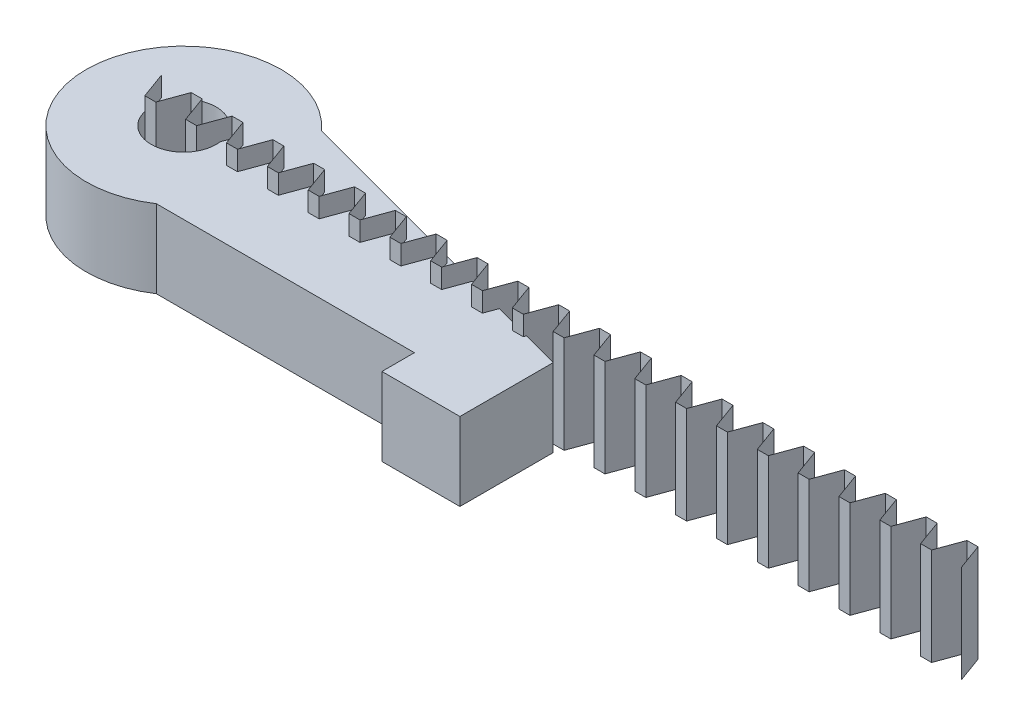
ISO-10303-21;
HEADER;
FILE_DESCRIPTION(('STEP AP214'),'2;1');
FILE_NAME('part.step','',(''),(''),'','','');
FILE_SCHEMA(('AUTOMOTIVE_DESIGN { 1 0 10303 214 1 1 1 1 }'));
ENDSEC;
DATA;
#1=APPLICATION_CONTEXT('core data for automotive mechanical design processes');
#2=APPLICATION_PROTOCOL_DEFINITION('international standard','automotive_design',2000,#1);
#3=PRODUCT_CONTEXT('',#1,'mechanical');
#4=PRODUCT('Part','Part','',(#3));
#5=PRODUCT_RELATED_PRODUCT_CATEGORY('part','',(#4));
#6=PRODUCT_DEFINITION_FORMATION('','',#4);
#7=PRODUCT_DEFINITION_CONTEXT('part definition',#1,'design');
#8=PRODUCT_DEFINITION('design','',#6,#7);
#9=PRODUCT_DEFINITION_SHAPE('','',#8);
#10=(LENGTH_UNIT() NAMED_UNIT(*) SI_UNIT(.MILLI.,.METRE.));
#11=(NAMED_UNIT(*) PLANE_ANGLE_UNIT() SI_UNIT($,.RADIAN.));
#12=(NAMED_UNIT(*) SI_UNIT($,.STERADIAN.) SOLID_ANGLE_UNIT());
#13=UNCERTAINTY_MEASURE_WITH_UNIT(LENGTH_MEASURE(1.E-05),#10,'distance_accuracy_value','');
#14=(GEOMETRIC_REPRESENTATION_CONTEXT(3) GLOBAL_UNCERTAINTY_ASSIGNED_CONTEXT((#13)) GLOBAL_UNIT_ASSIGNED_CONTEXT((#10,
#11,#12)) REPRESENTATION_CONTEXT('',''));
#15=CARTESIAN_POINT('',(0.,0.,0.));
#16=DIRECTION('',(0.,0.,1.));
#17=DIRECTION('',(1.,0.,0.));
#18=AXIS2_PLACEMENT_3D('',#15,#16,#17);
#19=CARTESIAN_POINT('',(-5.4403294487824,0.,-2.));
#20=DIRECTION('',(-0.939692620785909,0.,0.342020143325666));
#21=DIRECTION('',(0.342020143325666,0.,0.939692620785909));
#22=AXIS2_PLACEMENT_3D('',#19,#20,#21);
#23=PLANE('',#22);
#24=DIRECTION('',(0.342020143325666,0.,0.939692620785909));
#25=VECTOR('',#24,1.);
#26=CARTESIAN_POINT('',(-5.4403294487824,15.,-2.));
#27=LINE('',#26,#25);
#28=CARTESIAN_POINT('',(-5.4403294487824,15.,-2.));
#29=VERTEX_POINT('',#28);
#30=CARTESIAN_POINT('',(-3.9844485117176,15.,2.));
#31=VERTEX_POINT('',#30);
#32=EDGE_CURVE('E554',#29,#31,#27,.T.);
#33=ORIENTED_EDGE('',*,*,#32,.F.);
#34=DIRECTION('',(0.,1.,0.));
#35=VECTOR('',#34,1.);
#36=CARTESIAN_POINT('',(-5.4403294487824,0.,-2.));
#37=LINE('',#36,#35);
#38=CARTESIAN_POINT('',(-5.4403294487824,0.,-2.));
#39=VERTEX_POINT('',#38);
#40=EDGE_CURVE('E49',#39,#29,#37,.T.);
#41=ORIENTED_EDGE('',*,*,#40,.F.);
#42=DIRECTION('',(0.342020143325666,0.,0.939692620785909));
#43=VECTOR('',#42,1.);
#44=CARTESIAN_POINT('',(-5.4403294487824,0.,-2.));
#45=LINE('',#44,#43);
#46=CARTESIAN_POINT('',(-3.9844485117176,0.,2.));
#47=VERTEX_POINT('',#46);
#48=EDGE_CURVE('E12',#39,#47,#45,.T.);
#49=ORIENTED_EDGE('',*,*,#48,.T.);
#50=DIRECTION('',(0.,1.,0.));
#51=VECTOR('',#50,1.);
#52=CARTESIAN_POINT('',(-3.9844485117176,0.,2.));
#53=LINE('',#52,#51);
#54=EDGE_CURVE('E556',#47,#31,#53,.T.);
#55=ORIENTED_EDGE('',*,*,#54,.T.);
#56=EDGE_LOOP('',(#33,#41,#49,#55));
#57=FACE_BOUND('',#56,.T.);
#58=ADVANCED_FACE('F47',(#57),#23,.T.);
#59=CARTESIAN_POINT('',(-3.9844485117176,0.,2.));
#60=DIRECTION('',(0.,0.,1.));
#61=DIRECTION('',(1.,0.,0.));
#62=AXIS2_PLACEMENT_3D('',#59,#60,#61);
#63=PLANE('',#62);
#64=DIRECTION('',(1.,0.,0.));
#65=VECTOR('',#64,1.);
#66=CARTESIAN_POINT('',(-3.9844485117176,15.,2.));
#67=LINE('',#66,#65);
#68=CARTESIAN_POINT('',(-2.2987367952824,15.,2.));
#69=VERTEX_POINT('',#68);
#70=EDGE_CURVE('E567',#31,#69,#67,.T.);
#71=ORIENTED_EDGE('',*,*,#70,.F.);
#72=ORIENTED_EDGE('',*,*,#54,.F.);
#73=DIRECTION('',(1.,0.,0.));
#74=VECTOR('',#73,1.);
#75=CARTESIAN_POINT('',(-3.9844485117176,0.,2.));
#76=LINE('',#75,#74);
#77=CARTESIAN_POINT('',(-2.2987367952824,0.,2.));
#78=VERTEX_POINT('',#77);
#79=EDGE_CURVE('E559',#47,#78,#76,.T.);
#80=ORIENTED_EDGE('',*,*,#79,.T.);
#81=DIRECTION('',(0.,1.,0.));
#82=VECTOR('',#81,1.);
#83=CARTESIAN_POINT('',(-2.2987367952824,0.,2.));
#84=LINE('',#83,#82);
#85=EDGE_CURVE('E576',#78,#69,#84,.T.);
#86=ORIENTED_EDGE('',*,*,#85,.T.);
#87=EDGE_LOOP('',(#71,#72,#80,#86));
#88=FACE_BOUND('',#87,.T.);
#89=ADVANCED_FACE('F1362',(#88),#63,.T.);
#90=CARTESIAN_POINT('',(-2.2987367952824,0.,2.));
#91=DIRECTION('',(0.939692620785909,0.,0.342020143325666));
#92=DIRECTION('',(0.342020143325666,0.,-0.939692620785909));
#93=AXIS2_PLACEMENT_3D('',#90,#91,#92);
#94=PLANE('',#93);
#95=DIRECTION('',(0.342020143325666,0.,-0.939692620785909));
#96=VECTOR('',#95,1.);
#97=CARTESIAN_POINT('',(-2.2987367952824,15.,2.));
#98=LINE('',#97,#96);
#99=CARTESIAN_POINT('',(-0.842855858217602,15.,-2.));
#100=VERTEX_POINT('',#99);
#101=EDGE_CURVE('E572',#69,#100,#98,.T.);
#102=ORIENTED_EDGE('',*,*,#101,.F.);
#103=ORIENTED_EDGE('',*,*,#85,.F.);
#104=DIRECTION('',(0.342020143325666,0.,-0.939692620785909));
#105=VECTOR('',#104,1.);
#106=CARTESIAN_POINT('',(-2.2987367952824,0.,2.));
#107=LINE('',#106,#105);
#108=CARTESIAN_POINT('',(-0.842855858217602,0.,-2.));
#109=VERTEX_POINT('',#108);
#110=EDGE_CURVE('E571',#78,#109,#107,.T.);
#111=ORIENTED_EDGE('',*,*,#110,.T.);
#112=DIRECTION('',(0.,1.,0.));
#113=VECTOR('',#112,1.);
#114=CARTESIAN_POINT('',(-0.842855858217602,0.,-2.));
#115=LINE('',#114,#113);
#116=EDGE_CURVE('E582',#109,#100,#115,.T.);
#117=ORIENTED_EDGE('',*,*,#116,.T.);
#118=EDGE_LOOP('',(#102,#103,#111,#117));
#119=FACE_BOUND('',#118,.T.);
#120=ADVANCED_FACE('F1366',(#119),#94,.T.);
#121=CARTESIAN_POINT('',(-0.842855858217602,0.,-2.));
#122=DIRECTION('',(0.,0.,1.));
#123=DIRECTION('',(1.,0.,0.));
#124=AXIS2_PLACEMENT_3D('',#121,#122,#123);
#125=PLANE('',#124);
#126=DIRECTION('',(1.,0.,0.));
#127=VECTOR('',#126,1.);
#128=CARTESIAN_POINT('',(-0.842855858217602,15.,-2.));
#129=LINE('',#128,#127);
#130=CARTESIAN_POINT('',(0.842855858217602,15.,-2.));
#131=VERTEX_POINT('',#130);
#132=EDGE_CURVE('E578',#100,#131,#129,.T.);
#133=ORIENTED_EDGE('',*,*,#132,.F.);
#134=ORIENTED_EDGE('',*,*,#116,.F.);
#135=DIRECTION('',(1.,0.,0.));
#136=VECTOR('',#135,1.);
#137=CARTESIAN_POINT('',(-0.842855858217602,0.,-2.));
#138=LINE('',#137,#136);
#139=CARTESIAN_POINT('',(0.842855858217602,0.,-2.));
#140=VERTEX_POINT('',#139);
#141=EDGE_CURVE('E577',#109,#140,#138,.T.);
#142=ORIENTED_EDGE('',*,*,#141,.T.);
#143=DIRECTION('',(0.,1.,0.));
#144=VECTOR('',#143,1.);
#145=CARTESIAN_POINT('',(0.842855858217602,0.,-2.));
#146=LINE('',#145,#144);
#147=EDGE_CURVE('E588',#140,#131,#146,.T.);
#148=ORIENTED_EDGE('',*,*,#147,.T.);
#149=EDGE_LOOP('',(#133,#134,#142,#148));
#150=FACE_BOUND('',#149,.T.);
#151=ADVANCED_FACE('F1370',(#150),#125,.T.);
#152=CARTESIAN_POINT('',(0.842855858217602,0.,-2.));
#153=DIRECTION('',(-0.939692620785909,0.,0.342020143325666));
#154=DIRECTION('',(0.342020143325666,0.,0.939692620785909));
#155=AXIS2_PLACEMENT_3D('',#152,#153,#154);
#156=PLANE('',#155);
#157=DIRECTION('',(0.342020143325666,0.,0.939692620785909));
#158=VECTOR('',#157,1.);
#159=CARTESIAN_POINT('',(0.842855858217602,15.,-2.));
#160=LINE('',#159,#158);
#161=CARTESIAN_POINT('',(2.2987367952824,15.,2.));
#162=VERTEX_POINT('',#161);
#163=EDGE_CURVE('E584',#131,#162,#160,.T.);
#164=ORIENTED_EDGE('',*,*,#163,.F.);
#165=ORIENTED_EDGE('',*,*,#147,.F.);
#166=DIRECTION('',(0.342020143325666,0.,0.939692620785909));
#167=VECTOR('',#166,1.);
#168=CARTESIAN_POINT('',(0.842855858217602,0.,-2.));
#169=LINE('',#168,#167);
#170=CARTESIAN_POINT('',(2.2987367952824,0.,2.));
#171=VERTEX_POINT('',#170);
#172=EDGE_CURVE('E583',#140,#171,#169,.T.);
#173=ORIENTED_EDGE('',*,*,#172,.T.);
#174=DIRECTION('',(0.,1.,0.));
#175=VECTOR('',#174,1.);
#176=CARTESIAN_POINT('',(2.2987367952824,0.,2.));
#177=LINE('',#176,#175);
#178=EDGE_CURVE('E594',#171,#162,#177,.T.);
#179=ORIENTED_EDGE('',*,*,#178,.T.);
#180=EDGE_LOOP('',(#164,#165,#173,#179));
#181=FACE_BOUND('',#180,.T.);
#182=ADVANCED_FACE('F1374',(#181),#156,.T.);
#183=CARTESIAN_POINT('',(2.2987367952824,0.,2.));
#184=DIRECTION('',(0.,0.,1.));
#185=DIRECTION('',(1.,0.,0.));
#186=AXIS2_PLACEMENT_3D('',#183,#184,#185);
#187=PLANE('',#186);
#188=DIRECTION('',(1.,0.,0.));
#189=VECTOR('',#188,1.);
#190=CARTESIAN_POINT('',(2.2987367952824,15.,2.));
#191=LINE('',#190,#189);
#192=CARTESIAN_POINT('',(3.9844485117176,15.,2.));
#193=VERTEX_POINT('',#192);
#194=EDGE_CURVE('E590',#162,#193,#191,.T.);
#195=ORIENTED_EDGE('',*,*,#194,.F.);
#196=ORIENTED_EDGE('',*,*,#178,.F.);
#197=DIRECTION('',(1.,0.,0.));
#198=VECTOR('',#197,1.);
#199=CARTESIAN_POINT('',(2.2987367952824,0.,2.));
#200=LINE('',#199,#198);
#201=CARTESIAN_POINT('',(3.9844485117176,0.,2.));
#202=VERTEX_POINT('',#201);
#203=EDGE_CURVE('E589',#171,#202,#200,.T.);
#204=ORIENTED_EDGE('',*,*,#203,.T.);
#205=DIRECTION('',(0.,1.,0.));
#206=VECTOR('',#205,1.);
#207=CARTESIAN_POINT('',(3.9844485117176,0.,2.));
#208=LINE('',#207,#206);
#209=EDGE_CURVE('E600',#202,#193,#208,.T.);
#210=ORIENTED_EDGE('',*,*,#209,.T.);
#211=EDGE_LOOP('',(#195,#196,#204,#210));
#212=FACE_BOUND('',#211,.T.);
#213=ADVANCED_FACE('F1378',(#212),#187,.T.);
#214=CARTESIAN_POINT('',(3.9844485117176,0.,2.));
#215=DIRECTION('',(0.939692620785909,0.,0.342020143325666));
#216=DIRECTION('',(0.342020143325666,0.,-0.939692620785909));
#217=AXIS2_PLACEMENT_3D('',#214,#215,#216);
#218=PLANE('',#217);
#219=DIRECTION('',(0.342020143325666,0.,-0.939692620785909));
#220=VECTOR('',#219,1.);
#221=CARTESIAN_POINT('',(3.9844485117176,15.,2.));
#222=LINE('',#221,#220);
#223=CARTESIAN_POINT('',(5.4403294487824,15.,-2.));
#224=VERTEX_POINT('',#223);
#225=EDGE_CURVE('E596',#193,#224,#222,.T.);
#226=ORIENTED_EDGE('',*,*,#225,.F.);
#227=ORIENTED_EDGE('',*,*,#209,.F.);
#228=DIRECTION('',(0.342020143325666,0.,-0.939692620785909));
#229=VECTOR('',#228,1.);
#230=CARTESIAN_POINT('',(3.9844485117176,0.,2.));
#231=LINE('',#230,#229);
#232=CARTESIAN_POINT('',(5.4403294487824,0.,-2.));
#233=VERTEX_POINT('',#232);
#234=EDGE_CURVE('E595',#202,#233,#231,.T.);
#235=ORIENTED_EDGE('',*,*,#234,.T.);
#236=DIRECTION('',(0.,1.,0.));
#237=VECTOR('',#236,1.);
#238=CARTESIAN_POINT('',(5.4403294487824,0.,-2.));
#239=LINE('',#238,#237);
#240=EDGE_CURVE('E606',#233,#224,#239,.T.);
#241=ORIENTED_EDGE('',*,*,#240,.T.);
#242=EDGE_LOOP('',(#226,#227,#235,#241));
#243=FACE_BOUND('',#242,.T.);
#244=ADVANCED_FACE('F1382',(#243),#218,.T.);
#245=CARTESIAN_POINT('',(5.4403294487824,0.,-2.));
#246=DIRECTION('',(0.,0.,1.));
#247=DIRECTION('',(1.,0.,0.));
#248=AXIS2_PLACEMENT_3D('',#245,#246,#247);
#249=PLANE('',#248);
#250=DIRECTION('',(1.,0.,0.));
#251=VECTOR('',#250,1.);
#252=CARTESIAN_POINT('',(5.4403294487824,15.,-2.));
#253=LINE('',#252,#251);
#254=CARTESIAN_POINT('',(7.1260411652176,15.,-2.));
#255=VERTEX_POINT('',#254);
#256=EDGE_CURVE('E602',#224,#255,#253,.T.);
#257=ORIENTED_EDGE('',*,*,#256,.F.);
#258=ORIENTED_EDGE('',*,*,#240,.F.);
#259=DIRECTION('',(1.,0.,0.));
#260=VECTOR('',#259,1.);
#261=CARTESIAN_POINT('',(5.4403294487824,0.,-2.));
#262=LINE('',#261,#260);
#263=CARTESIAN_POINT('',(7.1260411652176,0.,-2.));
#264=VERTEX_POINT('',#263);
#265=EDGE_CURVE('E601',#233,#264,#262,.T.);
#266=ORIENTED_EDGE('',*,*,#265,.T.);
#267=DIRECTION('',(0.,1.,0.));
#268=VECTOR('',#267,1.);
#269=CARTESIAN_POINT('',(7.1260411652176,0.,-2.));
#270=LINE('',#269,#268);
#271=EDGE_CURVE('E612',#264,#255,#270,.T.);
#272=ORIENTED_EDGE('',*,*,#271,.T.);
#273=EDGE_LOOP('',(#257,#258,#266,#272));
#274=FACE_BOUND('',#273,.T.);
#275=ADVANCED_FACE('F1386',(#274),#249,.T.);
#276=CARTESIAN_POINT('',(7.1260411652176,0.,-2.));
#277=DIRECTION('',(-0.939692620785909,0.,0.342020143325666));
#278=DIRECTION('',(0.342020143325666,0.,0.939692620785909));
#279=AXIS2_PLACEMENT_3D('',#276,#277,#278);
#280=PLANE('',#279);
#281=DIRECTION('',(0.342020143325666,0.,0.939692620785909));
#282=VECTOR('',#281,1.);
#283=CARTESIAN_POINT('',(7.1260411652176,15.,-2.));
#284=LINE('',#283,#282);
#285=CARTESIAN_POINT('',(8.5819221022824,15.,2.));
#286=VERTEX_POINT('',#285);
#287=EDGE_CURVE('E608',#255,#286,#284,.T.);
#288=ORIENTED_EDGE('',*,*,#287,.F.);
#289=ORIENTED_EDGE('',*,*,#271,.F.);
#290=DIRECTION('',(0.342020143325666,0.,0.939692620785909));
#291=VECTOR('',#290,1.);
#292=CARTESIAN_POINT('',(7.1260411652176,0.,-2.));
#293=LINE('',#292,#291);
#294=CARTESIAN_POINT('',(8.5819221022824,0.,2.));
#295=VERTEX_POINT('',#294);
#296=EDGE_CURVE('E607',#264,#295,#293,.T.);
#297=ORIENTED_EDGE('',*,*,#296,.T.);
#298=DIRECTION('',(0.,1.,0.));
#299=VECTOR('',#298,1.);
#300=CARTESIAN_POINT('',(8.5819221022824,0.,2.));
#301=LINE('',#300,#299);
#302=EDGE_CURVE('E618',#295,#286,#301,.T.);
#303=ORIENTED_EDGE('',*,*,#302,.T.);
#304=EDGE_LOOP('',(#288,#289,#297,#303));
#305=FACE_BOUND('',#304,.T.);
#306=ADVANCED_FACE('F1390',(#305),#280,.T.);
#307=CARTESIAN_POINT('',(8.5819221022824,0.,2.));
#308=DIRECTION('',(0.,0.,1.));
#309=DIRECTION('',(1.,0.,0.));
#310=AXIS2_PLACEMENT_3D('',#307,#308,#309);
#311=PLANE('',#310);
#312=DIRECTION('',(1.,0.,0.));
#313=VECTOR('',#312,1.);
#314=CARTESIAN_POINT('',(8.5819221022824,15.,2.));
#315=LINE('',#314,#313);
#316=CARTESIAN_POINT('',(10.2676338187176,15.,2.));
#317=VERTEX_POINT('',#316);
#318=EDGE_CURVE('E614',#286,#317,#315,.T.);
#319=ORIENTED_EDGE('',*,*,#318,.F.);
#320=ORIENTED_EDGE('',*,*,#302,.F.);
#321=DIRECTION('',(1.,0.,0.));
#322=VECTOR('',#321,1.);
#323=CARTESIAN_POINT('',(8.5819221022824,0.,2.));
#324=LINE('',#323,#322);
#325=CARTESIAN_POINT('',(10.2676338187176,0.,2.));
#326=VERTEX_POINT('',#325);
#327=EDGE_CURVE('E613',#295,#326,#324,.T.);
#328=ORIENTED_EDGE('',*,*,#327,.T.);
#329=DIRECTION('',(0.,1.,0.));
#330=VECTOR('',#329,1.);
#331=CARTESIAN_POINT('',(10.2676338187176,0.,2.));
#332=LINE('',#331,#330);
#333=EDGE_CURVE('E624',#326,#317,#332,.T.);
#334=ORIENTED_EDGE('',*,*,#333,.T.);
#335=EDGE_LOOP('',(#319,#320,#328,#334));
#336=FACE_BOUND('',#335,.T.);
#337=ADVANCED_FACE('F1394',(#336),#311,.T.);
#338=CARTESIAN_POINT('',(10.2676338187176,0.,2.));
#339=DIRECTION('',(0.939692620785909,0.,0.342020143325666));
#340=DIRECTION('',(0.342020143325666,0.,-0.939692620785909));
#341=AXIS2_PLACEMENT_3D('',#338,#339,#340);
#342=PLANE('',#341);
#343=DIRECTION('',(0.342020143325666,0.,-0.939692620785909));
#344=VECTOR('',#343,1.);
#345=CARTESIAN_POINT('',(10.2676338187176,15.,2.));
#346=LINE('',#345,#344);
#347=CARTESIAN_POINT('',(11.7235147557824,15.,-2.));
#348=VERTEX_POINT('',#347);
#349=EDGE_CURVE('E620',#317,#348,#346,.T.);
#350=ORIENTED_EDGE('',*,*,#349,.F.);
#351=ORIENTED_EDGE('',*,*,#333,.F.);
#352=DIRECTION('',(0.342020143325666,0.,-0.939692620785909));
#353=VECTOR('',#352,1.);
#354=CARTESIAN_POINT('',(10.2676338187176,0.,2.));
#355=LINE('',#354,#353);
#356=CARTESIAN_POINT('',(11.7235147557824,0.,-2.));
#357=VERTEX_POINT('',#356);
#358=EDGE_CURVE('E619',#326,#357,#355,.T.);
#359=ORIENTED_EDGE('',*,*,#358,.T.);
#360=DIRECTION('',(0.,1.,0.));
#361=VECTOR('',#360,1.);
#362=CARTESIAN_POINT('',(11.7235147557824,0.,-2.));
#363=LINE('',#362,#361);
#364=EDGE_CURVE('E630',#357,#348,#363,.T.);
#365=ORIENTED_EDGE('',*,*,#364,.T.);
#366=EDGE_LOOP('',(#350,#351,#359,#365));
#367=FACE_BOUND('',#366,.T.);
#368=ADVANCED_FACE('F1398',(#367),#342,.T.);
#369=CARTESIAN_POINT('',(11.7235147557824,0.,-2.));
#370=DIRECTION('',(0.,0.,1.));
#371=DIRECTION('',(1.,0.,0.));
#372=AXIS2_PLACEMENT_3D('',#369,#370,#371);
#373=PLANE('',#372);
#374=DIRECTION('',(1.,0.,0.));
#375=VECTOR('',#374,1.);
#376=CARTESIAN_POINT('',(11.7235147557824,15.,-2.));
#377=LINE('',#376,#375);
#378=CARTESIAN_POINT('',(13.4092264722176,15.,-2.));
#379=VERTEX_POINT('',#378);
#380=EDGE_CURVE('E626',#348,#379,#377,.T.);
#381=ORIENTED_EDGE('',*,*,#380,.F.);
#382=ORIENTED_EDGE('',*,*,#364,.F.);
#383=DIRECTION('',(1.,0.,0.));
#384=VECTOR('',#383,1.);
#385=CARTESIAN_POINT('',(11.7235147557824,0.,-2.));
#386=LINE('',#385,#384);
#387=CARTESIAN_POINT('',(13.4092264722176,0.,-2.));
#388=VERTEX_POINT('',#387);
#389=EDGE_CURVE('E625',#357,#388,#386,.T.);
#390=ORIENTED_EDGE('',*,*,#389,.T.);
#391=DIRECTION('',(0.,1.,0.));
#392=VECTOR('',#391,1.);
#393=CARTESIAN_POINT('',(13.4092264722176,0.,-2.));
#394=LINE('',#393,#392);
#395=EDGE_CURVE('E636',#388,#379,#394,.T.);
#396=ORIENTED_EDGE('',*,*,#395,.T.);
#397=EDGE_LOOP('',(#381,#382,#390,#396));
#398=FACE_BOUND('',#397,.T.);
#399=ADVANCED_FACE('F1402',(#398),#373,.T.);
#400=CARTESIAN_POINT('',(13.4092264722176,0.,-2.));
#401=DIRECTION('',(-0.939692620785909,0.,0.342020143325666));
#402=DIRECTION('',(0.342020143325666,0.,0.939692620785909));
#403=AXIS2_PLACEMENT_3D('',#400,#401,#402);
#404=PLANE('',#403);
#405=DIRECTION('',(0.342020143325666,0.,0.939692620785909));
#406=VECTOR('',#405,1.);
#407=CARTESIAN_POINT('',(13.4092264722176,15.,-2.));
#408=LINE('',#407,#406);
#409=CARTESIAN_POINT('',(14.8651074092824,15.,2.));
#410=VERTEX_POINT('',#409);
#411=EDGE_CURVE('E632',#379,#410,#408,.T.);
#412=ORIENTED_EDGE('',*,*,#411,.F.);
#413=ORIENTED_EDGE('',*,*,#395,.F.);
#414=DIRECTION('',(0.342020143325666,0.,0.939692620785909));
#415=VECTOR('',#414,1.);
#416=CARTESIAN_POINT('',(13.4092264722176,0.,-2.));
#417=LINE('',#416,#415);
#418=CARTESIAN_POINT('',(14.8651074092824,0.,2.));
#419=VERTEX_POINT('',#418);
#420=EDGE_CURVE('E631',#388,#419,#417,.T.);
#421=ORIENTED_EDGE('',*,*,#420,.T.);
#422=DIRECTION('',(0.,1.,0.));
#423=VECTOR('',#422,1.);
#424=CARTESIAN_POINT('',(14.8651074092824,0.,2.));
#425=LINE('',#424,#423);
#426=EDGE_CURVE('E642',#419,#410,#425,.T.);
#427=ORIENTED_EDGE('',*,*,#426,.T.);
#428=EDGE_LOOP('',(#412,#413,#421,#427));
#429=FACE_BOUND('',#428,.T.);
#430=ADVANCED_FACE('F1406',(#429),#404,.T.);
#431=CARTESIAN_POINT('',(14.8651074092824,0.,2.));
#432=DIRECTION('',(0.,0.,1.));
#433=DIRECTION('',(1.,0.,0.));
#434=AXIS2_PLACEMENT_3D('',#431,#432,#433);
#435=PLANE('',#434);
#436=DIRECTION('',(1.,0.,0.));
#437=VECTOR('',#436,1.);
#438=CARTESIAN_POINT('',(14.8651074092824,15.,2.));
#439=LINE('',#438,#437);
#440=CARTESIAN_POINT('',(16.5508191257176,15.,2.));
#441=VERTEX_POINT('',#440);
#442=EDGE_CURVE('E638',#410,#441,#439,.T.);
#443=ORIENTED_EDGE('',*,*,#442,.F.);
#444=ORIENTED_EDGE('',*,*,#426,.F.);
#445=DIRECTION('',(1.,0.,0.));
#446=VECTOR('',#445,1.);
#447=CARTESIAN_POINT('',(14.8651074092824,0.,2.));
#448=LINE('',#447,#446);
#449=CARTESIAN_POINT('',(16.5508191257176,0.,2.));
#450=VERTEX_POINT('',#449);
#451=EDGE_CURVE('E637',#419,#450,#448,.T.);
#452=ORIENTED_EDGE('',*,*,#451,.T.);
#453=DIRECTION('',(0.,1.,0.));
#454=VECTOR('',#453,1.);
#455=CARTESIAN_POINT('',(16.5508191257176,0.,2.));
#456=LINE('',#455,#454);
#457=EDGE_CURVE('E648',#450,#441,#456,.T.);
#458=ORIENTED_EDGE('',*,*,#457,.T.);
#459=EDGE_LOOP('',(#443,#444,#452,#458));
#460=FACE_BOUND('',#459,.T.);
#461=ADVANCED_FACE('F1410',(#460),#435,.T.);
#462=CARTESIAN_POINT('',(16.5508191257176,0.,2.));
#463=DIRECTION('',(0.939692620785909,0.,0.342020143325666));
#464=DIRECTION('',(0.342020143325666,0.,-0.939692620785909));
#465=AXIS2_PLACEMENT_3D('',#462,#463,#464);
#466=PLANE('',#465);
#467=DIRECTION('',(0.342020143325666,0.,-0.939692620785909));
#468=VECTOR('',#467,1.);
#469=CARTESIAN_POINT('',(16.5508191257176,15.,2.));
#470=LINE('',#469,#468);
#471=CARTESIAN_POINT('',(18.0067000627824,15.,-2.));
#472=VERTEX_POINT('',#471);
#473=EDGE_CURVE('E644',#441,#472,#470,.T.);
#474=ORIENTED_EDGE('',*,*,#473,.F.);
#475=ORIENTED_EDGE('',*,*,#457,.F.);
#476=DIRECTION('',(0.342020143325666,0.,-0.939692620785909));
#477=VECTOR('',#476,1.);
#478=CARTESIAN_POINT('',(16.5508191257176,0.,2.));
#479=LINE('',#478,#477);
#480=CARTESIAN_POINT('',(18.0067000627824,0.,-2.));
#481=VERTEX_POINT('',#480);
#482=EDGE_CURVE('E643',#450,#481,#479,.T.);
#483=ORIENTED_EDGE('',*,*,#482,.T.);
#484=DIRECTION('',(0.,1.,0.));
#485=VECTOR('',#484,1.);
#486=CARTESIAN_POINT('',(18.0067000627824,0.,-2.));
#487=LINE('',#486,#485);
#488=EDGE_CURVE('E654',#481,#472,#487,.T.);
#489=ORIENTED_EDGE('',*,*,#488,.T.);
#490=EDGE_LOOP('',(#474,#475,#483,#489));
#491=FACE_BOUND('',#490,.T.);
#492=ADVANCED_FACE('F1414',(#491),#466,.T.);
#493=CARTESIAN_POINT('',(18.0067000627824,0.,-2.));
#494=DIRECTION('',(0.,0.,1.));
#495=DIRECTION('',(1.,0.,0.));
#496=AXIS2_PLACEMENT_3D('',#493,#494,#495);
#497=PLANE('',#496);
#498=DIRECTION('',(1.,0.,0.));
#499=VECTOR('',#498,1.);
#500=CARTESIAN_POINT('',(18.0067000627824,15.,-2.));
#501=LINE('',#500,#499);
#502=CARTESIAN_POINT('',(19.6924117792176,15.,-2.));
#503=VERTEX_POINT('',#502);
#504=EDGE_CURVE('E650',#472,#503,#501,.T.);
#505=ORIENTED_EDGE('',*,*,#504,.F.);
#506=ORIENTED_EDGE('',*,*,#488,.F.);
#507=DIRECTION('',(1.,0.,0.));
#508=VECTOR('',#507,1.);
#509=CARTESIAN_POINT('',(18.0067000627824,0.,-2.));
#510=LINE('',#509,#508);
#511=CARTESIAN_POINT('',(19.6924117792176,0.,-2.));
#512=VERTEX_POINT('',#511);
#513=EDGE_CURVE('E649',#481,#512,#510,.T.);
#514=ORIENTED_EDGE('',*,*,#513,.T.);
#515=DIRECTION('',(0.,1.,0.));
#516=VECTOR('',#515,1.);
#517=CARTESIAN_POINT('',(19.6924117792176,0.,-2.));
#518=LINE('',#517,#516);
#519=EDGE_CURVE('E660',#512,#503,#518,.T.);
#520=ORIENTED_EDGE('',*,*,#519,.T.);
#521=EDGE_LOOP('',(#505,#506,#514,#520));
#522=FACE_BOUND('',#521,.T.);
#523=ADVANCED_FACE('F1418',(#522),#497,.T.);
#524=CARTESIAN_POINT('',(19.6924117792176,0.,-2.));
#525=DIRECTION('',(-0.939692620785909,0.,0.342020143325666));
#526=DIRECTION('',(0.342020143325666,0.,0.939692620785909));
#527=AXIS2_PLACEMENT_3D('',#524,#525,#526);
#528=PLANE('',#527);
#529=DIRECTION('',(0.342020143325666,0.,0.939692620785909));
#530=VECTOR('',#529,1.);
#531=CARTESIAN_POINT('',(19.6924117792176,15.,-2.));
#532=LINE('',#531,#530);
#533=CARTESIAN_POINT('',(21.1482927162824,15.,2.));
#534=VERTEX_POINT('',#533);
#535=EDGE_CURVE('E656',#503,#534,#532,.T.);
#536=ORIENTED_EDGE('',*,*,#535,.F.);
#537=ORIENTED_EDGE('',*,*,#519,.F.);
#538=DIRECTION('',(0.342020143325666,0.,0.939692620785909));
#539=VECTOR('',#538,1.);
#540=CARTESIAN_POINT('',(19.6924117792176,0.,-2.));
#541=LINE('',#540,#539);
#542=CARTESIAN_POINT('',(21.1482927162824,0.,2.));
#543=VERTEX_POINT('',#542);
#544=EDGE_CURVE('E655',#512,#543,#541,.T.);
#545=ORIENTED_EDGE('',*,*,#544,.T.);
#546=DIRECTION('',(0.,1.,0.));
#547=VECTOR('',#546,1.);
#548=CARTESIAN_POINT('',(21.1482927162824,0.,2.));
#549=LINE('',#548,#547);
#550=EDGE_CURVE('E666',#543,#534,#549,.T.);
#551=ORIENTED_EDGE('',*,*,#550,.T.);
#552=EDGE_LOOP('',(#536,#537,#545,#551));
#553=FACE_BOUND('',#552,.T.);
#554=ADVANCED_FACE('F1422',(#553),#528,.T.);
#555=CARTESIAN_POINT('',(21.1482927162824,0.,2.));
#556=DIRECTION('',(0.,0.,1.));
#557=DIRECTION('',(1.,0.,0.));
#558=AXIS2_PLACEMENT_3D('',#555,#556,#557);
#559=PLANE('',#558);
#560=DIRECTION('',(1.,0.,0.));
#561=VECTOR('',#560,1.);
#562=CARTESIAN_POINT('',(21.1482927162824,15.,2.));
#563=LINE('',#562,#561);
#564=CARTESIAN_POINT('',(22.8340044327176,15.,2.));
#565=VERTEX_POINT('',#564);
#566=EDGE_CURVE('E662',#534,#565,#563,.T.);
#567=ORIENTED_EDGE('',*,*,#566,.F.);
#568=ORIENTED_EDGE('',*,*,#550,.F.);
#569=DIRECTION('',(1.,0.,0.));
#570=VECTOR('',#569,1.);
#571=CARTESIAN_POINT('',(21.1482927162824,0.,2.));
#572=LINE('',#571,#570);
#573=CARTESIAN_POINT('',(22.8340044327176,0.,2.));
#574=VERTEX_POINT('',#573);
#575=EDGE_CURVE('E661',#543,#574,#572,.T.);
#576=ORIENTED_EDGE('',*,*,#575,.T.);
#577=DIRECTION('',(0.,1.,0.));
#578=VECTOR('',#577,1.);
#579=CARTESIAN_POINT('',(22.8340044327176,0.,2.));
#580=LINE('',#579,#578);
#581=EDGE_CURVE('E672',#574,#565,#580,.T.);
#582=ORIENTED_EDGE('',*,*,#581,.T.);
#583=EDGE_LOOP('',(#567,#568,#576,#582));
#584=FACE_BOUND('',#583,.T.);
#585=ADVANCED_FACE('F1426',(#584),#559,.T.);
#586=CARTESIAN_POINT('',(22.8340044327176,0.,2.));
#587=DIRECTION('',(0.939692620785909,0.,0.342020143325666));
#588=DIRECTION('',(0.342020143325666,0.,-0.939692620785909));
#589=AXIS2_PLACEMENT_3D('',#586,#587,#588);
#590=PLANE('',#589);
#591=DIRECTION('',(0.342020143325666,0.,-0.939692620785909));
#592=VECTOR('',#591,1.);
#593=CARTESIAN_POINT('',(22.8340044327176,15.,2.));
#594=LINE('',#593,#592);
#595=CARTESIAN_POINT('',(24.2898853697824,15.,-2.));
#596=VERTEX_POINT('',#595);
#597=EDGE_CURVE('E668',#565,#596,#594,.T.);
#598=ORIENTED_EDGE('',*,*,#597,.F.);
#599=ORIENTED_EDGE('',*,*,#581,.F.);
#600=DIRECTION('',(0.342020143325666,0.,-0.939692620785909));
#601=VECTOR('',#600,1.);
#602=CARTESIAN_POINT('',(22.8340044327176,0.,2.));
#603=LINE('',#602,#601);
#604=CARTESIAN_POINT('',(24.2898853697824,0.,-2.));
#605=VERTEX_POINT('',#604);
#606=EDGE_CURVE('E667',#574,#605,#603,.T.);
#607=ORIENTED_EDGE('',*,*,#606,.T.);
#608=DIRECTION('',(0.,1.,0.));
#609=VECTOR('',#608,1.);
#610=CARTESIAN_POINT('',(24.2898853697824,0.,-2.));
#611=LINE('',#610,#609);
#612=EDGE_CURVE('E678',#605,#596,#611,.T.);
#613=ORIENTED_EDGE('',*,*,#612,.T.);
#614=EDGE_LOOP('',(#598,#599,#607,#613));
#615=FACE_BOUND('',#614,.T.);
#616=ADVANCED_FACE('F1430',(#615),#590,.T.);
#617=CARTESIAN_POINT('',(24.2898853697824,0.,-2.));
#618=DIRECTION('',(0.,0.,1.));
#619=DIRECTION('',(1.,0.,0.));
#620=AXIS2_PLACEMENT_3D('',#617,#618,#619);
#621=PLANE('',#620);
#622=DIRECTION('',(1.,0.,0.));
#623=VECTOR('',#622,1.);
#624=CARTESIAN_POINT('',(24.2898853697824,15.,-2.));
#625=LINE('',#624,#623);
#626=CARTESIAN_POINT('',(25.9755970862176,15.,-2.));
#627=VERTEX_POINT('',#626);
#628=EDGE_CURVE('E674',#596,#627,#625,.T.);
#629=ORIENTED_EDGE('',*,*,#628,.F.);
#630=ORIENTED_EDGE('',*,*,#612,.F.);
#631=DIRECTION('',(1.,0.,0.));
#632=VECTOR('',#631,1.);
#633=CARTESIAN_POINT('',(24.2898853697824,0.,-2.));
#634=LINE('',#633,#632);
#635=CARTESIAN_POINT('',(25.9755970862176,0.,-2.));
#636=VERTEX_POINT('',#635);
#637=EDGE_CURVE('E673',#605,#636,#634,.T.);
#638=ORIENTED_EDGE('',*,*,#637,.T.);
#639=DIRECTION('',(0.,1.,0.));
#640=VECTOR('',#639,1.);
#641=CARTESIAN_POINT('',(25.9755970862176,0.,-2.));
#642=LINE('',#641,#640);
#643=EDGE_CURVE('E684',#636,#627,#642,.T.);
#644=ORIENTED_EDGE('',*,*,#643,.T.);
#645=EDGE_LOOP('',(#629,#630,#638,#644));
#646=FACE_BOUND('',#645,.T.);
#647=ADVANCED_FACE('F1434',(#646),#621,.T.);
#648=CARTESIAN_POINT('',(25.9755970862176,0.,-2.));
#649=DIRECTION('',(-0.939692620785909,0.,0.342020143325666));
#650=DIRECTION('',(0.342020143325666,0.,0.939692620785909));
#651=AXIS2_PLACEMENT_3D('',#648,#649,#650);
#652=PLANE('',#651);
#653=DIRECTION('',(0.342020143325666,0.,0.939692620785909));
#654=VECTOR('',#653,1.);
#655=CARTESIAN_POINT('',(25.9755970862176,15.,-2.));
#656=LINE('',#655,#654);
#657=CARTESIAN_POINT('',(27.4314780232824,15.,2.));
#658=VERTEX_POINT('',#657);
#659=EDGE_CURVE('E680',#627,#658,#656,.T.);
#660=ORIENTED_EDGE('',*,*,#659,.F.);
#661=ORIENTED_EDGE('',*,*,#643,.F.);
#662=DIRECTION('',(0.342020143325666,0.,0.939692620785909));
#663=VECTOR('',#662,1.);
#664=CARTESIAN_POINT('',(25.9755970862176,0.,-2.));
#665=LINE('',#664,#663);
#666=CARTESIAN_POINT('',(27.4314780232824,0.,2.));
#667=VERTEX_POINT('',#666);
#668=EDGE_CURVE('E679',#636,#667,#665,.T.);
#669=ORIENTED_EDGE('',*,*,#668,.T.);
#670=DIRECTION('',(0.,1.,0.));
#671=VECTOR('',#670,1.);
#672=CARTESIAN_POINT('',(27.4314780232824,0.,2.));
#673=LINE('',#672,#671);
#674=EDGE_CURVE('E690',#667,#658,#673,.T.);
#675=ORIENTED_EDGE('',*,*,#674,.T.);
#676=EDGE_LOOP('',(#660,#661,#669,#675));
#677=FACE_BOUND('',#676,.T.);
#678=ADVANCED_FACE('F1438',(#677),#652,.T.);
#679=CARTESIAN_POINT('',(27.4314780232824,0.,2.));
#680=DIRECTION('',(0.,0.,1.));
#681=DIRECTION('',(1.,0.,0.));
#682=AXIS2_PLACEMENT_3D('',#679,#680,#681);
#683=PLANE('',#682);
#684=DIRECTION('',(1.,0.,0.));
#685=VECTOR('',#684,1.);
#686=CARTESIAN_POINT('',(27.4314780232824,15.,2.));
#687=LINE('',#686,#685);
#688=CARTESIAN_POINT('',(29.1171897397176,15.,2.));
#689=VERTEX_POINT('',#688);
#690=EDGE_CURVE('E686',#658,#689,#687,.T.);
#691=ORIENTED_EDGE('',*,*,#690,.F.);
#692=ORIENTED_EDGE('',*,*,#674,.F.);
#693=DIRECTION('',(1.,0.,0.));
#694=VECTOR('',#693,1.);
#695=CARTESIAN_POINT('',(27.4314780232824,0.,2.));
#696=LINE('',#695,#694);
#697=CARTESIAN_POINT('',(29.1171897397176,0.,2.));
#698=VERTEX_POINT('',#697);
#699=EDGE_CURVE('E685',#667,#698,#696,.T.);
#700=ORIENTED_EDGE('',*,*,#699,.T.);
#701=DIRECTION('',(0.,1.,0.));
#702=VECTOR('',#701,1.);
#703=CARTESIAN_POINT('',(29.1171897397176,0.,2.));
#704=LINE('',#703,#702);
#705=EDGE_CURVE('E696',#698,#689,#704,.T.);
#706=ORIENTED_EDGE('',*,*,#705,.T.);
#707=EDGE_LOOP('',(#691,#692,#700,#706));
#708=FACE_BOUND('',#707,.T.);
#709=ADVANCED_FACE('F1442',(#708),#683,.T.);
#710=CARTESIAN_POINT('',(29.1171897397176,0.,2.));
#711=DIRECTION('',(0.939692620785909,0.,0.342020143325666));
#712=DIRECTION('',(0.342020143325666,0.,-0.939692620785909));
#713=AXIS2_PLACEMENT_3D('',#710,#711,#712);
#714=PLANE('',#713);
#715=DIRECTION('',(0.342020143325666,0.,-0.939692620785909));
#716=VECTOR('',#715,1.);
#717=CARTESIAN_POINT('',(29.1171897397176,15.,2.));
#718=LINE('',#717,#716);
#719=CARTESIAN_POINT('',(30.5730706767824,15.,-2.));
#720=VERTEX_POINT('',#719);
#721=EDGE_CURVE('E692',#689,#720,#718,.T.);
#722=ORIENTED_EDGE('',*,*,#721,.F.);
#723=ORIENTED_EDGE('',*,*,#705,.F.);
#724=DIRECTION('',(0.342020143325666,0.,-0.939692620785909));
#725=VECTOR('',#724,1.);
#726=CARTESIAN_POINT('',(29.1171897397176,0.,2.));
#727=LINE('',#726,#725);
#728=CARTESIAN_POINT('',(30.5730706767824,0.,-2.));
#729=VERTEX_POINT('',#728);
#730=EDGE_CURVE('E691',#698,#729,#727,.T.);
#731=ORIENTED_EDGE('',*,*,#730,.T.);
#732=DIRECTION('',(0.,1.,0.));
#733=VECTOR('',#732,1.);
#734=CARTESIAN_POINT('',(30.5730706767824,0.,-2.));
#735=LINE('',#734,#733);
#736=EDGE_CURVE('E702',#729,#720,#735,.T.);
#737=ORIENTED_EDGE('',*,*,#736,.T.);
#738=EDGE_LOOP('',(#722,#723,#731,#737));
#739=FACE_BOUND('',#738,.T.);
#740=ADVANCED_FACE('F1446',(#739),#714,.T.);
#741=CARTESIAN_POINT('',(30.5730706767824,0.,-2.));
#742=DIRECTION('',(0.,0.,1.));
#743=DIRECTION('',(1.,0.,0.));
#744=AXIS2_PLACEMENT_3D('',#741,#742,#743);
#745=PLANE('',#744);
#746=DIRECTION('',(1.,0.,0.));
#747=VECTOR('',#746,1.);
#748=CARTESIAN_POINT('',(30.5730706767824,15.,-2.));
#749=LINE('',#748,#747);
#750=CARTESIAN_POINT('',(32.2587823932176,15.,-2.));
#751=VERTEX_POINT('',#750);
#752=EDGE_CURVE('E698',#720,#751,#749,.T.);
#753=ORIENTED_EDGE('',*,*,#752,.F.);
#754=ORIENTED_EDGE('',*,*,#736,.F.);
#755=DIRECTION('',(1.,0.,0.));
#756=VECTOR('',#755,1.);
#757=CARTESIAN_POINT('',(30.5730706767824,0.,-2.));
#758=LINE('',#757,#756);
#759=CARTESIAN_POINT('',(32.2587823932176,0.,-2.));
#760=VERTEX_POINT('',#759);
#761=EDGE_CURVE('E697',#729,#760,#758,.T.);
#762=ORIENTED_EDGE('',*,*,#761,.T.);
#763=DIRECTION('',(0.,1.,0.));
#764=VECTOR('',#763,1.);
#765=CARTESIAN_POINT('',(32.2587823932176,0.,-2.));
#766=LINE('',#765,#764);
#767=EDGE_CURVE('E708',#760,#751,#766,.T.);
#768=ORIENTED_EDGE('',*,*,#767,.T.);
#769=EDGE_LOOP('',(#753,#754,#762,#768));
#770=FACE_BOUND('',#769,.T.);
#771=ADVANCED_FACE('F1450',(#770),#745,.T.);
#772=CARTESIAN_POINT('',(32.2587823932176,0.,-2.));
#773=DIRECTION('',(-0.93969262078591,0.,0.342020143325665));
#774=DIRECTION('',(0.342020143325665,0.,0.93969262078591));
#775=AXIS2_PLACEMENT_3D('',#772,#773,#774);
#776=PLANE('',#775);
#777=DIRECTION('',(0.342020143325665,0.,0.93969262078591));
#778=VECTOR('',#777,1.);
#779=CARTESIAN_POINT('',(32.2587823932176,15.,-2.));
#780=LINE('',#779,#778);
#781=CARTESIAN_POINT('',(33.7146633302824,15.,2.));
#782=VERTEX_POINT('',#781);
#783=EDGE_CURVE('E704',#751,#782,#780,.T.);
#784=ORIENTED_EDGE('',*,*,#783,.F.);
#785=ORIENTED_EDGE('',*,*,#767,.F.);
#786=DIRECTION('',(0.342020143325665,0.,0.93969262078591));
#787=VECTOR('',#786,1.);
#788=CARTESIAN_POINT('',(32.2587823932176,0.,-2.));
#789=LINE('',#788,#787);
#790=CARTESIAN_POINT('',(33.7146633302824,0.,2.));
#791=VERTEX_POINT('',#790);
#792=EDGE_CURVE('E703',#760,#791,#789,.T.);
#793=ORIENTED_EDGE('',*,*,#792,.T.);
#794=DIRECTION('',(0.,1.,0.));
#795=VECTOR('',#794,1.);
#796=CARTESIAN_POINT('',(33.7146633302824,0.,2.));
#797=LINE('',#796,#795);
#798=EDGE_CURVE('E714',#791,#782,#797,.T.);
#799=ORIENTED_EDGE('',*,*,#798,.T.);
#800=EDGE_LOOP('',(#784,#785,#793,#799));
#801=FACE_BOUND('',#800,.T.);
#802=ADVANCED_FACE('F1454',(#801),#776,.T.);
#803=CARTESIAN_POINT('',(33.7146633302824,0.,2.));
#804=DIRECTION('',(0.,0.,1.));
#805=DIRECTION('',(1.,0.,0.));
#806=AXIS2_PLACEMENT_3D('',#803,#804,#805);
#807=PLANE('',#806);
#808=DIRECTION('',(1.,0.,0.));
#809=VECTOR('',#808,1.);
#810=CARTESIAN_POINT('',(33.7146633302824,15.,2.));
#811=LINE('',#810,#809);
#812=CARTESIAN_POINT('',(35.4003750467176,15.,2.));
#813=VERTEX_POINT('',#812);
#814=EDGE_CURVE('E710',#782,#813,#811,.T.);
#815=ORIENTED_EDGE('',*,*,#814,.F.);
#816=ORIENTED_EDGE('',*,*,#798,.F.);
#817=DIRECTION('',(1.,0.,0.));
#818=VECTOR('',#817,1.);
#819=CARTESIAN_POINT('',(33.7146633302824,0.,2.));
#820=LINE('',#819,#818);
#821=CARTESIAN_POINT('',(35.4003750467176,0.,2.));
#822=VERTEX_POINT('',#821);
#823=EDGE_CURVE('E709',#791,#822,#820,.T.);
#824=ORIENTED_EDGE('',*,*,#823,.T.);
#825=DIRECTION('',(0.,1.,0.));
#826=VECTOR('',#825,1.);
#827=CARTESIAN_POINT('',(35.4003750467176,0.,2.));
#828=LINE('',#827,#826);
#829=EDGE_CURVE('E720',#822,#813,#828,.T.);
#830=ORIENTED_EDGE('',*,*,#829,.T.);
#831=EDGE_LOOP('',(#815,#816,#824,#830));
#832=FACE_BOUND('',#831,.T.);
#833=ADVANCED_FACE('F1458',(#832),#807,.T.);
#834=CARTESIAN_POINT('',(35.4003750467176,0.,2.));
#835=DIRECTION('',(0.939692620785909,0.,0.342020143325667));
#836=DIRECTION('',(0.342020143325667,0.,-0.939692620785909));
#837=AXIS2_PLACEMENT_3D('',#834,#835,#836);
#838=PLANE('',#837);
#839=DIRECTION('',(0.342020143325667,0.,-0.939692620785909));
#840=VECTOR('',#839,1.);
#841=CARTESIAN_POINT('',(35.4003750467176,15.,2.));
#842=LINE('',#841,#840);
#843=CARTESIAN_POINT('',(36.8562559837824,15.,-2.));
#844=VERTEX_POINT('',#843);
#845=EDGE_CURVE('E716',#813,#844,#842,.T.);
#846=ORIENTED_EDGE('',*,*,#845,.F.);
#847=ORIENTED_EDGE('',*,*,#829,.F.);
#848=DIRECTION('',(0.342020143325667,0.,-0.939692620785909));
#849=VECTOR('',#848,1.);
#850=CARTESIAN_POINT('',(35.4003750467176,0.,2.));
#851=LINE('',#850,#849);
#852=CARTESIAN_POINT('',(36.8562559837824,0.,-2.));
#853=VERTEX_POINT('',#852);
#854=EDGE_CURVE('E715',#822,#853,#851,.T.);
#855=ORIENTED_EDGE('',*,*,#854,.T.);
#856=DIRECTION('',(0.,1.,0.));
#857=VECTOR('',#856,1.);
#858=CARTESIAN_POINT('',(36.8562559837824,0.,-2.));
#859=LINE('',#858,#857);
#860=EDGE_CURVE('E726',#853,#844,#859,.T.);
#861=ORIENTED_EDGE('',*,*,#860,.T.);
#862=EDGE_LOOP('',(#846,#847,#855,#861));
#863=FACE_BOUND('',#862,.T.);
#864=ADVANCED_FACE('F1462',(#863),#838,.T.);
#865=CARTESIAN_POINT('',(36.8562559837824,0.,-2.));
#866=DIRECTION('',(0.,0.,1.));
#867=DIRECTION('',(1.,0.,0.));
#868=AXIS2_PLACEMENT_3D('',#865,#866,#867);
#869=PLANE('',#868);
#870=DIRECTION('',(1.,0.,0.));
#871=VECTOR('',#870,1.);
#872=CARTESIAN_POINT('',(36.8562559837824,15.,-2.));
#873=LINE('',#872,#871);
#874=CARTESIAN_POINT('',(38.5419677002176,15.,-2.));
#875=VERTEX_POINT('',#874);
#876=EDGE_CURVE('E722',#844,#875,#873,.T.);
#877=ORIENTED_EDGE('',*,*,#876,.F.);
#878=ORIENTED_EDGE('',*,*,#860,.F.);
#879=DIRECTION('',(1.,0.,0.));
#880=VECTOR('',#879,1.);
#881=CARTESIAN_POINT('',(36.8562559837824,0.,-2.));
#882=LINE('',#881,#880);
#883=CARTESIAN_POINT('',(38.5419677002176,0.,-2.));
#884=VERTEX_POINT('',#883);
#885=EDGE_CURVE('E721',#853,#884,#882,.T.);
#886=ORIENTED_EDGE('',*,*,#885,.T.);
#887=DIRECTION('',(0.,1.,0.));
#888=VECTOR('',#887,1.);
#889=CARTESIAN_POINT('',(38.5419677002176,0.,-2.));
#890=LINE('',#889,#888);
#891=EDGE_CURVE('E732',#884,#875,#890,.T.);
#892=ORIENTED_EDGE('',*,*,#891,.T.);
#893=EDGE_LOOP('',(#877,#878,#886,#892));
#894=FACE_BOUND('',#893,.T.);
#895=ADVANCED_FACE('F1466',(#894),#869,.T.);
#896=CARTESIAN_POINT('',(38.5419677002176,0.,-2.));
#897=DIRECTION('',(-0.93969262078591,0.,0.342020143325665));
#898=DIRECTION('',(0.342020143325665,0.,0.93969262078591));
#899=AXIS2_PLACEMENT_3D('',#896,#897,#898);
#900=PLANE('',#899);
#901=DIRECTION('',(0.342020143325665,0.,0.93969262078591));
#902=VECTOR('',#901,1.);
#903=CARTESIAN_POINT('',(38.5419677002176,15.,-2.));
#904=LINE('',#903,#902);
#905=CARTESIAN_POINT('',(39.9978486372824,15.,2.));
#906=VERTEX_POINT('',#905);
#907=EDGE_CURVE('E728',#875,#906,#904,.T.);
#908=ORIENTED_EDGE('',*,*,#907,.F.);
#909=ORIENTED_EDGE('',*,*,#891,.F.);
#910=DIRECTION('',(0.342020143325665,0.,0.93969262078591));
#911=VECTOR('',#910,1.);
#912=CARTESIAN_POINT('',(38.5419677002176,0.,-2.));
#913=LINE('',#912,#911);
#914=CARTESIAN_POINT('',(39.9978486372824,0.,2.));
#915=VERTEX_POINT('',#914);
#916=EDGE_CURVE('E727',#884,#915,#913,.T.);
#917=ORIENTED_EDGE('',*,*,#916,.T.);
#918=DIRECTION('',(0.,1.,0.));
#919=VECTOR('',#918,1.);
#920=CARTESIAN_POINT('',(39.9978486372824,0.,2.));
#921=LINE('',#920,#919);
#922=EDGE_CURVE('E738',#915,#906,#921,.T.);
#923=ORIENTED_EDGE('',*,*,#922,.T.);
#924=EDGE_LOOP('',(#908,#909,#917,#923));
#925=FACE_BOUND('',#924,.T.);
#926=ADVANCED_FACE('F1470',(#925),#900,.T.);
#927=CARTESIAN_POINT('',(39.9978486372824,0.,2.));
#928=DIRECTION('',(0.,0.,1.));
#929=DIRECTION('',(1.,0.,0.));
#930=AXIS2_PLACEMENT_3D('',#927,#928,#929);
#931=PLANE('',#930);
#932=DIRECTION('',(1.,0.,0.));
#933=VECTOR('',#932,1.);
#934=CARTESIAN_POINT('',(39.9978486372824,15.,2.));
#935=LINE('',#934,#933);
#936=CARTESIAN_POINT('',(41.6835603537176,15.,2.));
#937=VERTEX_POINT('',#936);
#938=EDGE_CURVE('E734',#906,#937,#935,.T.);
#939=ORIENTED_EDGE('',*,*,#938,.F.);
#940=ORIENTED_EDGE('',*,*,#922,.F.);
#941=DIRECTION('',(1.,0.,0.));
#942=VECTOR('',#941,1.);
#943=CARTESIAN_POINT('',(39.9978486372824,0.,2.));
#944=LINE('',#943,#942);
#945=CARTESIAN_POINT('',(41.6835603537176,0.,2.));
#946=VERTEX_POINT('',#945);
#947=EDGE_CURVE('E733',#915,#946,#944,.T.);
#948=ORIENTED_EDGE('',*,*,#947,.T.);
#949=DIRECTION('',(0.,1.,0.));
#950=VECTOR('',#949,1.);
#951=CARTESIAN_POINT('',(41.6835603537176,0.,2.));
#952=LINE('',#951,#950);
#953=EDGE_CURVE('E744',#946,#937,#952,.T.);
#954=ORIENTED_EDGE('',*,*,#953,.T.);
#955=EDGE_LOOP('',(#939,#940,#948,#954));
#956=FACE_BOUND('',#955,.T.);
#957=ADVANCED_FACE('F1474',(#956),#931,.T.);
#958=CARTESIAN_POINT('',(41.6835603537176,0.,2.));
#959=DIRECTION('',(0.939692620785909,0.,0.342020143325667));
#960=DIRECTION('',(0.342020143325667,0.,-0.939692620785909));
#961=AXIS2_PLACEMENT_3D('',#958,#959,#960);
#962=PLANE('',#961);
#963=DIRECTION('',(0.342020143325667,0.,-0.939692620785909));
#964=VECTOR('',#963,1.);
#965=CARTESIAN_POINT('',(41.6835603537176,15.,2.));
#966=LINE('',#965,#964);
#967=CARTESIAN_POINT('',(43.1394412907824,15.,-2.));
#968=VERTEX_POINT('',#967);
#969=EDGE_CURVE('E740',#937,#968,#966,.T.);
#970=ORIENTED_EDGE('',*,*,#969,.F.);
#971=ORIENTED_EDGE('',*,*,#953,.F.);
#972=DIRECTION('',(0.342020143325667,0.,-0.939692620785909));
#973=VECTOR('',#972,1.);
#974=CARTESIAN_POINT('',(41.6835603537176,0.,2.));
#975=LINE('',#974,#973);
#976=CARTESIAN_POINT('',(43.1394412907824,0.,-2.));
#977=VERTEX_POINT('',#976);
#978=EDGE_CURVE('E739',#946,#977,#975,.T.);
#979=ORIENTED_EDGE('',*,*,#978,.T.);
#980=DIRECTION('',(0.,1.,0.));
#981=VECTOR('',#980,1.);
#982=CARTESIAN_POINT('',(43.1394412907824,0.,-2.));
#983=LINE('',#982,#981);
#984=EDGE_CURVE('E750',#977,#968,#983,.T.);
#985=ORIENTED_EDGE('',*,*,#984,.T.);
#986=EDGE_LOOP('',(#970,#971,#979,#985));
#987=FACE_BOUND('',#986,.T.);
#988=ADVANCED_FACE('F1478',(#987),#962,.T.);
#989=CARTESIAN_POINT('',(43.1394412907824,0.,-2.));
#990=DIRECTION('',(0.,0.,1.));
#991=DIRECTION('',(1.,0.,0.));
#992=AXIS2_PLACEMENT_3D('',#989,#990,#991);
#993=PLANE('',#992);
#994=DIRECTION('',(1.,0.,0.));
#995=VECTOR('',#994,1.);
#996=CARTESIAN_POINT('',(43.1394412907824,15.,-2.));
#997=LINE('',#996,#995);
#998=CARTESIAN_POINT('',(44.8251530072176,15.,-2.));
#999=VERTEX_POINT('',#998);
#1000=EDGE_CURVE('E746',#968,#999,#997,.T.);
#1001=ORIENTED_EDGE('',*,*,#1000,.F.);
#1002=ORIENTED_EDGE('',*,*,#984,.F.);
#1003=DIRECTION('',(1.,0.,0.));
#1004=VECTOR('',#1003,1.);
#1005=CARTESIAN_POINT('',(43.1394412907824,0.,-2.));
#1006=LINE('',#1005,#1004);
#1007=CARTESIAN_POINT('',(44.8251530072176,0.,-2.));
#1008=VERTEX_POINT('',#1007);
#1009=EDGE_CURVE('E745',#977,#1008,#1006,.T.);
#1010=ORIENTED_EDGE('',*,*,#1009,.T.);
#1011=DIRECTION('',(0.,1.,0.));
#1012=VECTOR('',#1011,1.);
#1013=CARTESIAN_POINT('',(44.8251530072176,0.,-2.));
#1014=LINE('',#1013,#1012);
#1015=EDGE_CURVE('E756',#1008,#999,#1014,.T.);
#1016=ORIENTED_EDGE('',*,*,#1015,.T.);
#1017=EDGE_LOOP('',(#1001,#1002,#1010,#1016));
#1018=FACE_BOUND('',#1017,.T.);
#1019=ADVANCED_FACE('F1482',(#1018),#993,.T.);
#1020=CARTESIAN_POINT('',(44.8251530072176,0.,-2.));
#1021=DIRECTION('',(-0.93969262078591,0.,0.342020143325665));
#1022=DIRECTION('',(0.342020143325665,0.,0.93969262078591));
#1023=AXIS2_PLACEMENT_3D('',#1020,#1021,#1022);
#1024=PLANE('',#1023);
#1025=DIRECTION('',(0.342020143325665,0.,0.93969262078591));
#1026=VECTOR('',#1025,1.);
#1027=CARTESIAN_POINT('',(44.8251530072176,15.,-2.));
#1028=LINE('',#1027,#1026);
#1029=CARTESIAN_POINT('',(46.2810339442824,15.,2.));
#1030=VERTEX_POINT('',#1029);
#1031=EDGE_CURVE('E752',#999,#1030,#1028,.T.);
#1032=ORIENTED_EDGE('',*,*,#1031,.F.);
#1033=ORIENTED_EDGE('',*,*,#1015,.F.);
#1034=DIRECTION('',(0.342020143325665,0.,0.93969262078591));
#1035=VECTOR('',#1034,1.);
#1036=CARTESIAN_POINT('',(44.8251530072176,0.,-2.));
#1037=LINE('',#1036,#1035);
#1038=CARTESIAN_POINT('',(46.2810339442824,0.,2.));
#1039=VERTEX_POINT('',#1038);
#1040=EDGE_CURVE('E751',#1008,#1039,#1037,.T.);
#1041=ORIENTED_EDGE('',*,*,#1040,.T.);
#1042=DIRECTION('',(0.,1.,0.));
#1043=VECTOR('',#1042,1.);
#1044=CARTESIAN_POINT('',(46.2810339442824,0.,2.));
#1045=LINE('',#1044,#1043);
#1046=EDGE_CURVE('E762',#1039,#1030,#1045,.T.);
#1047=ORIENTED_EDGE('',*,*,#1046,.T.);
#1048=EDGE_LOOP('',(#1032,#1033,#1041,#1047));
#1049=FACE_BOUND('',#1048,.T.);
#1050=ADVANCED_FACE('F1486',(#1049),#1024,.T.);
#1051=CARTESIAN_POINT('',(46.2810339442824,0.,2.));
#1052=DIRECTION('',(0.,0.,1.));
#1053=DIRECTION('',(1.,0.,0.));
#1054=AXIS2_PLACEMENT_3D('',#1051,#1052,#1053);
#1055=PLANE('',#1054);
#1056=DIRECTION('',(1.,0.,0.));
#1057=VECTOR('',#1056,1.);
#1058=CARTESIAN_POINT('',(46.2810339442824,15.,2.));
#1059=LINE('',#1058,#1057);
#1060=CARTESIAN_POINT('',(47.9667456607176,15.,2.));
#1061=VERTEX_POINT('',#1060);
#1062=EDGE_CURVE('E758',#1030,#1061,#1059,.T.);
#1063=ORIENTED_EDGE('',*,*,#1062,.F.);
#1064=ORIENTED_EDGE('',*,*,#1046,.F.);
#1065=DIRECTION('',(1.,0.,0.));
#1066=VECTOR('',#1065,1.);
#1067=CARTESIAN_POINT('',(46.2810339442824,0.,2.));
#1068=LINE('',#1067,#1066);
#1069=CARTESIAN_POINT('',(47.9667456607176,0.,2.));
#1070=VERTEX_POINT('',#1069);
#1071=EDGE_CURVE('E757',#1039,#1070,#1068,.T.);
#1072=ORIENTED_EDGE('',*,*,#1071,.T.);
#1073=DIRECTION('',(0.,1.,0.));
#1074=VECTOR('',#1073,1.);
#1075=CARTESIAN_POINT('',(47.9667456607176,0.,2.));
#1076=LINE('',#1075,#1074);
#1077=EDGE_CURVE('E768',#1070,#1061,#1076,.T.);
#1078=ORIENTED_EDGE('',*,*,#1077,.T.);
#1079=EDGE_LOOP('',(#1063,#1064,#1072,#1078));
#1080=FACE_BOUND('',#1079,.T.);
#1081=ADVANCED_FACE('F1490',(#1080),#1055,.T.);
#1082=CARTESIAN_POINT('',(47.9667456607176,0.,2.));
#1083=DIRECTION('',(0.939692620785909,0.,0.342020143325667));
#1084=DIRECTION('',(0.342020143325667,0.,-0.939692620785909));
#1085=AXIS2_PLACEMENT_3D('',#1082,#1083,#1084);
#1086=PLANE('',#1085);
#1087=DIRECTION('',(0.342020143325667,0.,-0.939692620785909));
#1088=VECTOR('',#1087,1.);
#1089=CARTESIAN_POINT('',(47.9667456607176,15.,2.));
#1090=LINE('',#1089,#1088);
#1091=CARTESIAN_POINT('',(49.4226265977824,15.,-2.));
#1092=VERTEX_POINT('',#1091);
#1093=EDGE_CURVE('E764',#1061,#1092,#1090,.T.);
#1094=ORIENTED_EDGE('',*,*,#1093,.F.);
#1095=ORIENTED_EDGE('',*,*,#1077,.F.);
#1096=DIRECTION('',(0.342020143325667,0.,-0.939692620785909));
#1097=VECTOR('',#1096,1.);
#1098=CARTESIAN_POINT('',(47.9667456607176,0.,2.));
#1099=LINE('',#1098,#1097);
#1100=CARTESIAN_POINT('',(49.4226265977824,0.,-2.));
#1101=VERTEX_POINT('',#1100);
#1102=EDGE_CURVE('E763',#1070,#1101,#1099,.T.);
#1103=ORIENTED_EDGE('',*,*,#1102,.T.);
#1104=DIRECTION('',(0.,1.,0.));
#1105=VECTOR('',#1104,1.);
#1106=CARTESIAN_POINT('',(49.4226265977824,0.,-2.));
#1107=LINE('',#1106,#1105);
#1108=EDGE_CURVE('E774',#1101,#1092,#1107,.T.);
#1109=ORIENTED_EDGE('',*,*,#1108,.T.);
#1110=EDGE_LOOP('',(#1094,#1095,#1103,#1109));
#1111=FACE_BOUND('',#1110,.T.);
#1112=ADVANCED_FACE('F1494',(#1111),#1086,.T.);
#1113=CARTESIAN_POINT('',(49.4226265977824,0.,-2.));
#1114=DIRECTION('',(0.,0.,1.));
#1115=DIRECTION('',(1.,0.,0.));
#1116=AXIS2_PLACEMENT_3D('',#1113,#1114,#1115);
#1117=PLANE('',#1116);
#1118=DIRECTION('',(1.,0.,0.));
#1119=VECTOR('',#1118,1.);
#1120=CARTESIAN_POINT('',(49.4226265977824,15.,-2.));
#1121=LINE('',#1120,#1119);
#1122=CARTESIAN_POINT('',(51.1083383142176,15.,-2.));
#1123=VERTEX_POINT('',#1122);
#1124=EDGE_CURVE('E770',#1092,#1123,#1121,.T.);
#1125=ORIENTED_EDGE('',*,*,#1124,.F.);
#1126=ORIENTED_EDGE('',*,*,#1108,.F.);
#1127=DIRECTION('',(1.,0.,0.));
#1128=VECTOR('',#1127,1.);
#1129=CARTESIAN_POINT('',(49.4226265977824,0.,-2.));
#1130=LINE('',#1129,#1128);
#1131=CARTESIAN_POINT('',(51.1083383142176,0.,-2.));
#1132=VERTEX_POINT('',#1131);
#1133=EDGE_CURVE('E769',#1101,#1132,#1130,.T.);
#1134=ORIENTED_EDGE('',*,*,#1133,.T.);
#1135=DIRECTION('',(0.,1.,0.));
#1136=VECTOR('',#1135,1.);
#1137=CARTESIAN_POINT('',(51.1083383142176,0.,-2.));
#1138=LINE('',#1137,#1136);
#1139=EDGE_CURVE('E780',#1132,#1123,#1138,.T.);
#1140=ORIENTED_EDGE('',*,*,#1139,.T.);
#1141=EDGE_LOOP('',(#1125,#1126,#1134,#1140));
#1142=FACE_BOUND('',#1141,.T.);
#1143=ADVANCED_FACE('F1498',(#1142),#1117,.T.);
#1144=CARTESIAN_POINT('',(51.1083383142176,0.,-2.));
#1145=DIRECTION('',(-0.93969262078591,0.,0.342020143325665));
#1146=DIRECTION('',(0.342020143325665,0.,0.93969262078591));
#1147=AXIS2_PLACEMENT_3D('',#1144,#1145,#1146);
#1148=PLANE('',#1147);
#1149=DIRECTION('',(0.342020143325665,0.,0.93969262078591));
#1150=VECTOR('',#1149,1.);
#1151=CARTESIAN_POINT('',(51.1083383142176,15.,-2.));
#1152=LINE('',#1151,#1150);
#1153=CARTESIAN_POINT('',(52.5642192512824,15.,2.));
#1154=VERTEX_POINT('',#1153);
#1155=EDGE_CURVE('E776',#1123,#1154,#1152,.T.);
#1156=ORIENTED_EDGE('',*,*,#1155,.F.);
#1157=ORIENTED_EDGE('',*,*,#1139,.F.);
#1158=DIRECTION('',(0.342020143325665,0.,0.93969262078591));
#1159=VECTOR('',#1158,1.);
#1160=CARTESIAN_POINT('',(51.1083383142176,0.,-2.));
#1161=LINE('',#1160,#1159);
#1162=CARTESIAN_POINT('',(52.5642192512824,0.,2.));
#1163=VERTEX_POINT('',#1162);
#1164=EDGE_CURVE('E775',#1132,#1163,#1161,.T.);
#1165=ORIENTED_EDGE('',*,*,#1164,.T.);
#1166=DIRECTION('',(0.,1.,0.));
#1167=VECTOR('',#1166,1.);
#1168=CARTESIAN_POINT('',(52.5642192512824,0.,2.));
#1169=LINE('',#1168,#1167);
#1170=EDGE_CURVE('E786',#1163,#1154,#1169,.T.);
#1171=ORIENTED_EDGE('',*,*,#1170,.T.);
#1172=EDGE_LOOP('',(#1156,#1157,#1165,#1171));
#1173=FACE_BOUND('',#1172,.T.);
#1174=ADVANCED_FACE('F1502',(#1173),#1148,.T.);
#1175=CARTESIAN_POINT('',(52.5642192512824,0.,2.));
#1176=DIRECTION('',(0.,0.,1.));
#1177=DIRECTION('',(1.,0.,0.));
#1178=AXIS2_PLACEMENT_3D('',#1175,#1176,#1177);
#1179=PLANE('',#1178);
#1180=DIRECTION('',(1.,0.,0.));
#1181=VECTOR('',#1180,1.);
#1182=CARTESIAN_POINT('',(52.5642192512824,15.,2.));
#1183=LINE('',#1182,#1181);
#1184=CARTESIAN_POINT('',(54.2499309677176,15.,2.));
#1185=VERTEX_POINT('',#1184);
#1186=EDGE_CURVE('E782',#1154,#1185,#1183,.T.);
#1187=ORIENTED_EDGE('',*,*,#1186,.F.);
#1188=ORIENTED_EDGE('',*,*,#1170,.F.);
#1189=DIRECTION('',(1.,0.,0.));
#1190=VECTOR('',#1189,1.);
#1191=CARTESIAN_POINT('',(52.5642192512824,0.,2.));
#1192=LINE('',#1191,#1190);
#1193=CARTESIAN_POINT('',(54.2499309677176,0.,2.));
#1194=VERTEX_POINT('',#1193);
#1195=EDGE_CURVE('E781',#1163,#1194,#1192,.T.);
#1196=ORIENTED_EDGE('',*,*,#1195,.T.);
#1197=DIRECTION('',(0.,1.,0.));
#1198=VECTOR('',#1197,1.);
#1199=CARTESIAN_POINT('',(54.2499309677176,0.,2.));
#1200=LINE('',#1199,#1198);
#1201=EDGE_CURVE('E792',#1194,#1185,#1200,.T.);
#1202=ORIENTED_EDGE('',*,*,#1201,.T.);
#1203=EDGE_LOOP('',(#1187,#1188,#1196,#1202));
#1204=FACE_BOUND('',#1203,.T.);
#1205=ADVANCED_FACE('F1506',(#1204),#1179,.T.);
#1206=CARTESIAN_POINT('',(54.2499309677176,0.,2.));
#1207=DIRECTION('',(0.939692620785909,0.,0.342020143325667));
#1208=DIRECTION('',(0.342020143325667,0.,-0.939692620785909));
#1209=AXIS2_PLACEMENT_3D('',#1206,#1207,#1208);
#1210=PLANE('',#1209);
#1211=DIRECTION('',(0.342020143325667,0.,-0.939692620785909));
#1212=VECTOR('',#1211,1.);
#1213=CARTESIAN_POINT('',(54.2499309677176,15.,2.));
#1214=LINE('',#1213,#1212);
#1215=CARTESIAN_POINT('',(55.7058119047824,15.,-2.));
#1216=VERTEX_POINT('',#1215);
#1217=EDGE_CURVE('E788',#1185,#1216,#1214,.T.);
#1218=ORIENTED_EDGE('',*,*,#1217,.F.);
#1219=ORIENTED_EDGE('',*,*,#1201,.F.);
#1220=DIRECTION('',(0.342020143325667,0.,-0.939692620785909));
#1221=VECTOR('',#1220,1.);
#1222=CARTESIAN_POINT('',(54.2499309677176,0.,2.));
#1223=LINE('',#1222,#1221);
#1224=CARTESIAN_POINT('',(55.7058119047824,0.,-2.));
#1225=VERTEX_POINT('',#1224);
#1226=EDGE_CURVE('E787',#1194,#1225,#1223,.T.);
#1227=ORIENTED_EDGE('',*,*,#1226,.T.);
#1228=DIRECTION('',(0.,1.,0.));
#1229=VECTOR('',#1228,1.);
#1230=CARTESIAN_POINT('',(55.7058119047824,0.,-2.));
#1231=LINE('',#1230,#1229);
#1232=EDGE_CURVE('E798',#1225,#1216,#1231,.T.);
#1233=ORIENTED_EDGE('',*,*,#1232,.T.);
#1234=EDGE_LOOP('',(#1218,#1219,#1227,#1233));
#1235=FACE_BOUND('',#1234,.T.);
#1236=ADVANCED_FACE('F1510',(#1235),#1210,.T.);
#1237=CARTESIAN_POINT('',(55.7058119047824,0.,-2.));
#1238=DIRECTION('',(0.,0.,1.));
#1239=DIRECTION('',(1.,0.,0.));
#1240=AXIS2_PLACEMENT_3D('',#1237,#1238,#1239);
#1241=PLANE('',#1240);
#1242=DIRECTION('',(1.,0.,0.));
#1243=VECTOR('',#1242,1.);
#1244=CARTESIAN_POINT('',(55.7058119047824,15.,-2.));
#1245=LINE('',#1244,#1243);
#1246=CARTESIAN_POINT('',(57.3915236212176,15.,-2.));
#1247=VERTEX_POINT('',#1246);
#1248=EDGE_CURVE('E794',#1216,#1247,#1245,.T.);
#1249=ORIENTED_EDGE('',*,*,#1248,.F.);
#1250=ORIENTED_EDGE('',*,*,#1232,.F.);
#1251=DIRECTION('',(1.,0.,0.));
#1252=VECTOR('',#1251,1.);
#1253=CARTESIAN_POINT('',(55.7058119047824,0.,-2.));
#1254=LINE('',#1253,#1252);
#1255=CARTESIAN_POINT('',(57.3915236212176,0.,-2.));
#1256=VERTEX_POINT('',#1255);
#1257=EDGE_CURVE('E793',#1225,#1256,#1254,.T.);
#1258=ORIENTED_EDGE('',*,*,#1257,.T.);
#1259=DIRECTION('',(0.,1.,0.));
#1260=VECTOR('',#1259,1.);
#1261=CARTESIAN_POINT('',(57.3915236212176,0.,-2.));
#1262=LINE('',#1261,#1260);
#1263=EDGE_CURVE('E804',#1256,#1247,#1262,.T.);
#1264=ORIENTED_EDGE('',*,*,#1263,.T.);
#1265=EDGE_LOOP('',(#1249,#1250,#1258,#1264));
#1266=FACE_BOUND('',#1265,.T.);
#1267=ADVANCED_FACE('F1514',(#1266),#1241,.T.);
#1268=CARTESIAN_POINT('',(57.3915236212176,0.,-2.));
#1269=DIRECTION('',(-0.93969262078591,0.,0.342020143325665));
#1270=DIRECTION('',(0.342020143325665,0.,0.93969262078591));
#1271=AXIS2_PLACEMENT_3D('',#1268,#1269,#1270);
#1272=PLANE('',#1271);
#1273=DIRECTION('',(0.342020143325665,0.,0.93969262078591));
#1274=VECTOR('',#1273,1.);
#1275=CARTESIAN_POINT('',(57.3915236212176,15.,-2.));
#1276=LINE('',#1275,#1274);
#1277=CARTESIAN_POINT('',(58.8474045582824,15.,2.));
#1278=VERTEX_POINT('',#1277);
#1279=EDGE_CURVE('E800',#1247,#1278,#1276,.T.);
#1280=ORIENTED_EDGE('',*,*,#1279,.F.);
#1281=ORIENTED_EDGE('',*,*,#1263,.F.);
#1282=DIRECTION('',(0.342020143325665,0.,0.93969262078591));
#1283=VECTOR('',#1282,1.);
#1284=CARTESIAN_POINT('',(57.3915236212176,0.,-2.));
#1285=LINE('',#1284,#1283);
#1286=CARTESIAN_POINT('',(58.8474045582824,0.,2.));
#1287=VERTEX_POINT('',#1286);
#1288=EDGE_CURVE('E799',#1256,#1287,#1285,.T.);
#1289=ORIENTED_EDGE('',*,*,#1288,.T.);
#1290=DIRECTION('',(0.,1.,0.));
#1291=VECTOR('',#1290,1.);
#1292=CARTESIAN_POINT('',(58.8474045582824,0.,2.));
#1293=LINE('',#1292,#1291);
#1294=EDGE_CURVE('E810',#1287,#1278,#1293,.T.);
#1295=ORIENTED_EDGE('',*,*,#1294,.T.);
#1296=EDGE_LOOP('',(#1280,#1281,#1289,#1295));
#1297=FACE_BOUND('',#1296,.T.);
#1298=ADVANCED_FACE('F1518',(#1297),#1272,.T.);
#1299=CARTESIAN_POINT('',(58.8474045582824,0.,2.));
#1300=DIRECTION('',(0.,0.,1.));
#1301=DIRECTION('',(1.,0.,0.));
#1302=AXIS2_PLACEMENT_3D('',#1299,#1300,#1301);
#1303=PLANE('',#1302);
#1304=DIRECTION('',(1.,0.,0.));
#1305=VECTOR('',#1304,1.);
#1306=CARTESIAN_POINT('',(58.8474045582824,15.,2.));
#1307=LINE('',#1306,#1305);
#1308=CARTESIAN_POINT('',(60.5331162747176,15.,2.));
#1309=VERTEX_POINT('',#1308);
#1310=EDGE_CURVE('E806',#1278,#1309,#1307,.T.);
#1311=ORIENTED_EDGE('',*,*,#1310,.F.);
#1312=ORIENTED_EDGE('',*,*,#1294,.F.);
#1313=DIRECTION('',(1.,0.,0.));
#1314=VECTOR('',#1313,1.);
#1315=CARTESIAN_POINT('',(58.8474045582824,0.,2.));
#1316=LINE('',#1315,#1314);
#1317=CARTESIAN_POINT('',(60.5331162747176,0.,2.));
#1318=VERTEX_POINT('',#1317);
#1319=EDGE_CURVE('E805',#1287,#1318,#1316,.T.);
#1320=ORIENTED_EDGE('',*,*,#1319,.T.);
#1321=DIRECTION('',(0.,1.,0.));
#1322=VECTOR('',#1321,1.);
#1323=CARTESIAN_POINT('',(60.5331162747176,0.,2.));
#1324=LINE('',#1323,#1322);
#1325=EDGE_CURVE('E816',#1318,#1309,#1324,.T.);
#1326=ORIENTED_EDGE('',*,*,#1325,.T.);
#1327=EDGE_LOOP('',(#1311,#1312,#1320,#1326));
#1328=FACE_BOUND('',#1327,.T.);
#1329=ADVANCED_FACE('F1522',(#1328),#1303,.T.);
#1330=CARTESIAN_POINT('',(60.5331162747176,0.,2.));
#1331=DIRECTION('',(0.939692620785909,0.,0.342020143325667));
#1332=DIRECTION('',(0.342020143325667,0.,-0.939692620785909));
#1333=AXIS2_PLACEMENT_3D('',#1330,#1331,#1332);
#1334=PLANE('',#1333);
#1335=DIRECTION('',(0.342020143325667,0.,-0.939692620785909));
#1336=VECTOR('',#1335,1.);
#1337=CARTESIAN_POINT('',(60.5331162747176,15.,2.));
#1338=LINE('',#1337,#1336);
#1339=CARTESIAN_POINT('',(61.9889972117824,15.,-2.));
#1340=VERTEX_POINT('',#1339);
#1341=EDGE_CURVE('E812',#1309,#1340,#1338,.T.);
#1342=ORIENTED_EDGE('',*,*,#1341,.F.);
#1343=ORIENTED_EDGE('',*,*,#1325,.F.);
#1344=DIRECTION('',(0.342020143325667,0.,-0.939692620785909));
#1345=VECTOR('',#1344,1.);
#1346=CARTESIAN_POINT('',(60.5331162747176,0.,2.));
#1347=LINE('',#1346,#1345);
#1348=CARTESIAN_POINT('',(61.9889972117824,0.,-2.));
#1349=VERTEX_POINT('',#1348);
#1350=EDGE_CURVE('E811',#1318,#1349,#1347,.T.);
#1351=ORIENTED_EDGE('',*,*,#1350,.T.);
#1352=DIRECTION('',(0.,1.,0.));
#1353=VECTOR('',#1352,1.);
#1354=CARTESIAN_POINT('',(61.9889972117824,0.,-2.));
#1355=LINE('',#1354,#1353);
#1356=EDGE_CURVE('E822',#1349,#1340,#1355,.T.);
#1357=ORIENTED_EDGE('',*,*,#1356,.T.);
#1358=EDGE_LOOP('',(#1342,#1343,#1351,#1357));
#1359=FACE_BOUND('',#1358,.T.);
#1360=ADVANCED_FACE('F1526',(#1359),#1334,.T.);
#1361=CARTESIAN_POINT('',(61.9889972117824,0.,-2.));
#1362=DIRECTION('',(0.,0.,1.));
#1363=DIRECTION('',(1.,0.,0.));
#1364=AXIS2_PLACEMENT_3D('',#1361,#1362,#1363);
#1365=PLANE('',#1364);
#1366=DIRECTION('',(1.,0.,0.));
#1367=VECTOR('',#1366,1.);
#1368=CARTESIAN_POINT('',(61.9889972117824,15.,-2.));
#1369=LINE('',#1368,#1367);
#1370=CARTESIAN_POINT('',(63.6747089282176,15.,-2.));
#1371=VERTEX_POINT('',#1370);
#1372=EDGE_CURVE('E818',#1340,#1371,#1369,.T.);
#1373=ORIENTED_EDGE('',*,*,#1372,.F.);
#1374=ORIENTED_EDGE('',*,*,#1356,.F.);
#1375=DIRECTION('',(1.,0.,0.));
#1376=VECTOR('',#1375,1.);
#1377=CARTESIAN_POINT('',(61.9889972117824,0.,-2.));
#1378=LINE('',#1377,#1376);
#1379=CARTESIAN_POINT('',(63.6747089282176,0.,-2.));
#1380=VERTEX_POINT('',#1379);
#1381=EDGE_CURVE('E817',#1349,#1380,#1378,.T.);
#1382=ORIENTED_EDGE('',*,*,#1381,.T.);
#1383=DIRECTION('',(0.,1.,0.));
#1384=VECTOR('',#1383,1.);
#1385=CARTESIAN_POINT('',(63.6747089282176,0.,-2.));
#1386=LINE('',#1385,#1384);
#1387=EDGE_CURVE('E828',#1380,#1371,#1386,.T.);
#1388=ORIENTED_EDGE('',*,*,#1387,.T.);
#1389=EDGE_LOOP('',(#1373,#1374,#1382,#1388));
#1390=FACE_BOUND('',#1389,.T.);
#1391=ADVANCED_FACE('F1530',(#1390),#1365,.T.);
#1392=CARTESIAN_POINT('',(63.6747089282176,0.,-2.));
#1393=DIRECTION('',(-0.939692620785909,0.,0.342020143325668));
#1394=DIRECTION('',(0.342020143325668,0.,0.939692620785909));
#1395=AXIS2_PLACEMENT_3D('',#1392,#1393,#1394);
#1396=PLANE('',#1395);
#1397=DIRECTION('',(0.342020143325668,0.,0.939692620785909));
#1398=VECTOR('',#1397,1.);
#1399=CARTESIAN_POINT('',(63.6747089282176,15.,-2.));
#1400=LINE('',#1399,#1398);
#1401=CARTESIAN_POINT('',(65.1305898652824,15.,2.));
#1402=VERTEX_POINT('',#1401);
#1403=EDGE_CURVE('E824',#1371,#1402,#1400,.T.);
#1404=ORIENTED_EDGE('',*,*,#1403,.F.);
#1405=ORIENTED_EDGE('',*,*,#1387,.F.);
#1406=DIRECTION('',(0.342020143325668,0.,0.939692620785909));
#1407=VECTOR('',#1406,1.);
#1408=CARTESIAN_POINT('',(63.6747089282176,0.,-2.));
#1409=LINE('',#1408,#1407);
#1410=CARTESIAN_POINT('',(65.1305898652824,0.,2.));
#1411=VERTEX_POINT('',#1410);
#1412=EDGE_CURVE('E823',#1380,#1411,#1409,.T.);
#1413=ORIENTED_EDGE('',*,*,#1412,.T.);
#1414=DIRECTION('',(0.,1.,0.));
#1415=VECTOR('',#1414,1.);
#1416=CARTESIAN_POINT('',(65.1305898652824,0.,2.));
#1417=LINE('',#1416,#1415);
#1418=EDGE_CURVE('E834',#1411,#1402,#1417,.T.);
#1419=ORIENTED_EDGE('',*,*,#1418,.T.);
#1420=EDGE_LOOP('',(#1404,#1405,#1413,#1419));
#1421=FACE_BOUND('',#1420,.T.);
#1422=ADVANCED_FACE('F1534',(#1421),#1396,.T.);
#1423=CARTESIAN_POINT('',(65.1305898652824,0.,2.));
#1424=DIRECTION('',(0.,0.,1.));
#1425=DIRECTION('',(1.,0.,0.));
#1426=AXIS2_PLACEMENT_3D('',#1423,#1424,#1425);
#1427=PLANE('',#1426);
#1428=DIRECTION('',(1.,0.,0.));
#1429=VECTOR('',#1428,1.);
#1430=CARTESIAN_POINT('',(65.1305898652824,15.,2.));
#1431=LINE('',#1430,#1429);
#1432=CARTESIAN_POINT('',(66.8163015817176,15.,2.));
#1433=VERTEX_POINT('',#1432);
#1434=EDGE_CURVE('E830',#1402,#1433,#1431,.T.);
#1435=ORIENTED_EDGE('',*,*,#1434,.F.);
#1436=ORIENTED_EDGE('',*,*,#1418,.F.);
#1437=DIRECTION('',(1.,0.,0.));
#1438=VECTOR('',#1437,1.);
#1439=CARTESIAN_POINT('',(65.1305898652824,0.,2.));
#1440=LINE('',#1439,#1438);
#1441=CARTESIAN_POINT('',(66.8163015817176,0.,2.));
#1442=VERTEX_POINT('',#1441);
#1443=EDGE_CURVE('E829',#1411,#1442,#1440,.T.);
#1444=ORIENTED_EDGE('',*,*,#1443,.T.);
#1445=DIRECTION('',(0.,1.,0.));
#1446=VECTOR('',#1445,1.);
#1447=CARTESIAN_POINT('',(66.8163015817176,0.,2.));
#1448=LINE('',#1447,#1446);
#1449=EDGE_CURVE('E840',#1442,#1433,#1448,.T.);
#1450=ORIENTED_EDGE('',*,*,#1449,.T.);
#1451=EDGE_LOOP('',(#1435,#1436,#1444,#1450));
#1452=FACE_BOUND('',#1451,.T.);
#1453=ADVANCED_FACE('F1538',(#1452),#1427,.T.);
#1454=CARTESIAN_POINT('',(66.8163015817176,0.,2.));
#1455=DIRECTION('',(0.939692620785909,0.,0.342020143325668));
#1456=DIRECTION('',(0.342020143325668,0.,-0.939692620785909));
#1457=AXIS2_PLACEMENT_3D('',#1454,#1455,#1456);
#1458=PLANE('',#1457);
#1459=DIRECTION('',(0.342020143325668,0.,-0.939692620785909));
#1460=VECTOR('',#1459,1.);
#1461=CARTESIAN_POINT('',(66.8163015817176,15.,2.));
#1462=LINE('',#1461,#1460);
#1463=CARTESIAN_POINT('',(68.2721825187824,15.,-2.));
#1464=VERTEX_POINT('',#1463);
#1465=EDGE_CURVE('E836',#1433,#1464,#1462,.T.);
#1466=ORIENTED_EDGE('',*,*,#1465,.F.);
#1467=ORIENTED_EDGE('',*,*,#1449,.F.);
#1468=DIRECTION('',(0.342020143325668,0.,-0.939692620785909));
#1469=VECTOR('',#1468,1.);
#1470=CARTESIAN_POINT('',(66.8163015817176,0.,2.));
#1471=LINE('',#1470,#1469);
#1472=CARTESIAN_POINT('',(68.2721825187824,0.,-2.));
#1473=VERTEX_POINT('',#1472);
#1474=EDGE_CURVE('E835',#1442,#1473,#1471,.T.);
#1475=ORIENTED_EDGE('',*,*,#1474,.T.);
#1476=DIRECTION('',(0.,1.,0.));
#1477=VECTOR('',#1476,1.);
#1478=CARTESIAN_POINT('',(68.2721825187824,0.,-2.));
#1479=LINE('',#1478,#1477);
#1480=EDGE_CURVE('E846',#1473,#1464,#1479,.T.);
#1481=ORIENTED_EDGE('',*,*,#1480,.T.);
#1482=EDGE_LOOP('',(#1466,#1467,#1475,#1481));
#1483=FACE_BOUND('',#1482,.T.);
#1484=ADVANCED_FACE('F1542',(#1483),#1458,.T.);
#1485=CARTESIAN_POINT('',(68.2721825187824,0.,-2.));
#1486=DIRECTION('',(0.,0.,1.));
#1487=DIRECTION('',(1.,0.,0.));
#1488=AXIS2_PLACEMENT_3D('',#1485,#1486,#1487);
#1489=PLANE('',#1488);
#1490=DIRECTION('',(1.,0.,0.));
#1491=VECTOR('',#1490,1.);
#1492=CARTESIAN_POINT('',(68.2721825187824,15.,-2.));
#1493=LINE('',#1492,#1491);
#1494=CARTESIAN_POINT('',(69.9578942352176,15.,-2.));
#1495=VERTEX_POINT('',#1494);
#1496=EDGE_CURVE('E842',#1464,#1495,#1493,.T.);
#1497=ORIENTED_EDGE('',*,*,#1496,.F.);
#1498=ORIENTED_EDGE('',*,*,#1480,.F.);
#1499=DIRECTION('',(1.,0.,0.));
#1500=VECTOR('',#1499,1.);
#1501=CARTESIAN_POINT('',(68.2721825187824,0.,-2.));
#1502=LINE('',#1501,#1500);
#1503=CARTESIAN_POINT('',(69.9578942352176,0.,-2.));
#1504=VERTEX_POINT('',#1503);
#1505=EDGE_CURVE('E841',#1473,#1504,#1502,.T.);
#1506=ORIENTED_EDGE('',*,*,#1505,.T.);
#1507=DIRECTION('',(0.,1.,0.));
#1508=VECTOR('',#1507,1.);
#1509=CARTESIAN_POINT('',(69.9578942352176,0.,-2.));
#1510=LINE('',#1509,#1508);
#1511=EDGE_CURVE('E852',#1504,#1495,#1510,.T.);
#1512=ORIENTED_EDGE('',*,*,#1511,.T.);
#1513=EDGE_LOOP('',(#1497,#1498,#1506,#1512));
#1514=FACE_BOUND('',#1513,.T.);
#1515=ADVANCED_FACE('F1546',(#1514),#1489,.T.);
#1516=CARTESIAN_POINT('',(69.9578942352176,0.,-2.));
#1517=DIRECTION('',(-0.939692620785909,0.,0.342020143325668));
#1518=DIRECTION('',(0.342020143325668,0.,0.939692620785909));
#1519=AXIS2_PLACEMENT_3D('',#1516,#1517,#1518);
#1520=PLANE('',#1519);
#1521=DIRECTION('',(0.342020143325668,0.,0.939692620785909));
#1522=VECTOR('',#1521,1.);
#1523=CARTESIAN_POINT('',(69.9578942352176,15.,-2.));
#1524=LINE('',#1523,#1522);
#1525=CARTESIAN_POINT('',(71.4137751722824,15.,2.));
#1526=VERTEX_POINT('',#1525);
#1527=EDGE_CURVE('E848',#1495,#1526,#1524,.T.);
#1528=ORIENTED_EDGE('',*,*,#1527,.F.);
#1529=ORIENTED_EDGE('',*,*,#1511,.F.);
#1530=DIRECTION('',(0.342020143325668,0.,0.939692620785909));
#1531=VECTOR('',#1530,1.);
#1532=CARTESIAN_POINT('',(69.9578942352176,0.,-2.));
#1533=LINE('',#1532,#1531);
#1534=CARTESIAN_POINT('',(71.4137751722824,0.,2.));
#1535=VERTEX_POINT('',#1534);
#1536=EDGE_CURVE('E847',#1504,#1535,#1533,.T.);
#1537=ORIENTED_EDGE('',*,*,#1536,.T.);
#1538=DIRECTION('',(0.,1.,0.));
#1539=VECTOR('',#1538,1.);
#1540=CARTESIAN_POINT('',(71.4137751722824,0.,2.));
#1541=LINE('',#1540,#1539);
#1542=EDGE_CURVE('E858',#1535,#1526,#1541,.T.);
#1543=ORIENTED_EDGE('',*,*,#1542,.T.);
#1544=EDGE_LOOP('',(#1528,#1529,#1537,#1543));
#1545=FACE_BOUND('',#1544,.T.);
#1546=ADVANCED_FACE('F1550',(#1545),#1520,.T.);
#1547=CARTESIAN_POINT('',(71.4137751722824,0.,2.));
#1548=DIRECTION('',(0.,0.,1.));
#1549=DIRECTION('',(1.,0.,0.));
#1550=AXIS2_PLACEMENT_3D('',#1547,#1548,#1549);
#1551=PLANE('',#1550);
#1552=DIRECTION('',(1.,0.,0.));
#1553=VECTOR('',#1552,1.);
#1554=CARTESIAN_POINT('',(71.4137751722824,15.,2.));
#1555=LINE('',#1554,#1553);
#1556=CARTESIAN_POINT('',(73.0994868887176,15.,2.));
#1557=VERTEX_POINT('',#1556);
#1558=EDGE_CURVE('E854',#1526,#1557,#1555,.T.);
#1559=ORIENTED_EDGE('',*,*,#1558,.F.);
#1560=ORIENTED_EDGE('',*,*,#1542,.F.);
#1561=DIRECTION('',(1.,0.,0.));
#1562=VECTOR('',#1561,1.);
#1563=CARTESIAN_POINT('',(71.4137751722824,0.,2.));
#1564=LINE('',#1563,#1562);
#1565=CARTESIAN_POINT('',(73.0994868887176,0.,2.));
#1566=VERTEX_POINT('',#1565);
#1567=EDGE_CURVE('E853',#1535,#1566,#1564,.T.);
#1568=ORIENTED_EDGE('',*,*,#1567,.T.);
#1569=DIRECTION('',(0.,1.,0.));
#1570=VECTOR('',#1569,1.);
#1571=CARTESIAN_POINT('',(73.0994868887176,0.,2.));
#1572=LINE('',#1571,#1570);
#1573=EDGE_CURVE('E864',#1566,#1557,#1572,.T.);
#1574=ORIENTED_EDGE('',*,*,#1573,.T.);
#1575=EDGE_LOOP('',(#1559,#1560,#1568,#1574));
#1576=FACE_BOUND('',#1575,.T.);
#1577=ADVANCED_FACE('F1554',(#1576),#1551,.T.);
#1578=CARTESIAN_POINT('',(73.0994868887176,0.,2.));
#1579=DIRECTION('',(0.939692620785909,0.,0.342020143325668));
#1580=DIRECTION('',(0.342020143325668,0.,-0.939692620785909));
#1581=AXIS2_PLACEMENT_3D('',#1578,#1579,#1580);
#1582=PLANE('',#1581);
#1583=DIRECTION('',(0.342020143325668,0.,-0.939692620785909));
#1584=VECTOR('',#1583,1.);
#1585=CARTESIAN_POINT('',(73.0994868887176,15.,2.));
#1586=LINE('',#1585,#1584);
#1587=CARTESIAN_POINT('',(74.5553678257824,15.,-2.));
#1588=VERTEX_POINT('',#1587);
#1589=EDGE_CURVE('E860',#1557,#1588,#1586,.T.);
#1590=ORIENTED_EDGE('',*,*,#1589,.F.);
#1591=ORIENTED_EDGE('',*,*,#1573,.F.);
#1592=DIRECTION('',(0.342020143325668,0.,-0.939692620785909));
#1593=VECTOR('',#1592,1.);
#1594=CARTESIAN_POINT('',(73.0994868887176,0.,2.));
#1595=LINE('',#1594,#1593);
#1596=CARTESIAN_POINT('',(74.5553678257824,0.,-2.));
#1597=VERTEX_POINT('',#1596);
#1598=EDGE_CURVE('E859',#1566,#1597,#1595,.T.);
#1599=ORIENTED_EDGE('',*,*,#1598,.T.);
#1600=DIRECTION('',(0.,1.,0.));
#1601=VECTOR('',#1600,1.);
#1602=CARTESIAN_POINT('',(74.5553678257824,0.,-2.));
#1603=LINE('',#1602,#1601);
#1604=EDGE_CURVE('E870',#1597,#1588,#1603,.T.);
#1605=ORIENTED_EDGE('',*,*,#1604,.T.);
#1606=EDGE_LOOP('',(#1590,#1591,#1599,#1605));
#1607=FACE_BOUND('',#1606,.T.);
#1608=ADVANCED_FACE('F1558',(#1607),#1582,.T.);
#1609=CARTESIAN_POINT('',(74.5553678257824,0.,-2.));
#1610=DIRECTION('',(0.,0.,1.));
#1611=DIRECTION('',(1.,0.,0.));
#1612=AXIS2_PLACEMENT_3D('',#1609,#1610,#1611);
#1613=PLANE('',#1612);
#1614=DIRECTION('',(1.,0.,0.));
#1615=VECTOR('',#1614,1.);
#1616=CARTESIAN_POINT('',(74.5553678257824,15.,-2.));
#1617=LINE('',#1616,#1615);
#1618=CARTESIAN_POINT('',(76.2410795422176,15.,-2.));
#1619=VERTEX_POINT('',#1618);
#1620=EDGE_CURVE('E866',#1588,#1619,#1617,.T.);
#1621=ORIENTED_EDGE('',*,*,#1620,.F.);
#1622=ORIENTED_EDGE('',*,*,#1604,.F.);
#1623=DIRECTION('',(1.,0.,0.));
#1624=VECTOR('',#1623,1.);
#1625=CARTESIAN_POINT('',(74.5553678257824,0.,-2.));
#1626=LINE('',#1625,#1624);
#1627=CARTESIAN_POINT('',(76.2410795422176,0.,-2.));
#1628=VERTEX_POINT('',#1627);
#1629=EDGE_CURVE('E865',#1597,#1628,#1626,.T.);
#1630=ORIENTED_EDGE('',*,*,#1629,.T.);
#1631=DIRECTION('',(0.,1.,0.));
#1632=VECTOR('',#1631,1.);
#1633=CARTESIAN_POINT('',(76.2410795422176,0.,-2.));
#1634=LINE('',#1633,#1632);
#1635=EDGE_CURVE('E876',#1628,#1619,#1634,.T.);
#1636=ORIENTED_EDGE('',*,*,#1635,.T.);
#1637=EDGE_LOOP('',(#1621,#1622,#1630,#1636));
#1638=FACE_BOUND('',#1637,.T.);
#1639=ADVANCED_FACE('F1562',(#1638),#1613,.T.);
#1640=CARTESIAN_POINT('',(76.2410795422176,0.,-2.));
#1641=DIRECTION('',(-0.939692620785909,0.,0.342020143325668));
#1642=DIRECTION('',(0.342020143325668,0.,0.939692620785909));
#1643=AXIS2_PLACEMENT_3D('',#1640,#1641,#1642);
#1644=PLANE('',#1643);
#1645=DIRECTION('',(0.342020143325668,0.,0.939692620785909));
#1646=VECTOR('',#1645,1.);
#1647=CARTESIAN_POINT('',(76.2410795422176,15.,-2.));
#1648=LINE('',#1647,#1646);
#1649=CARTESIAN_POINT('',(77.6969604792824,15.,2.));
#1650=VERTEX_POINT('',#1649);
#1651=EDGE_CURVE('E872',#1619,#1650,#1648,.T.);
#1652=ORIENTED_EDGE('',*,*,#1651,.F.);
#1653=ORIENTED_EDGE('',*,*,#1635,.F.);
#1654=DIRECTION('',(0.342020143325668,0.,0.939692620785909));
#1655=VECTOR('',#1654,1.);
#1656=CARTESIAN_POINT('',(76.2410795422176,0.,-2.));
#1657=LINE('',#1656,#1655);
#1658=CARTESIAN_POINT('',(77.6969604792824,0.,2.));
#1659=VERTEX_POINT('',#1658);
#1660=EDGE_CURVE('E871',#1628,#1659,#1657,.T.);
#1661=ORIENTED_EDGE('',*,*,#1660,.T.);
#1662=DIRECTION('',(0.,1.,0.));
#1663=VECTOR('',#1662,1.);
#1664=CARTESIAN_POINT('',(77.6969604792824,0.,2.));
#1665=LINE('',#1664,#1663);
#1666=EDGE_CURVE('E882',#1659,#1650,#1665,.T.);
#1667=ORIENTED_EDGE('',*,*,#1666,.T.);
#1668=EDGE_LOOP('',(#1652,#1653,#1661,#1667));
#1669=FACE_BOUND('',#1668,.T.);
#1670=ADVANCED_FACE('F1566',(#1669),#1644,.T.);
#1671=CARTESIAN_POINT('',(77.6969604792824,0.,2.));
#1672=DIRECTION('',(0.,0.,1.));
#1673=DIRECTION('',(1.,0.,0.));
#1674=AXIS2_PLACEMENT_3D('',#1671,#1672,#1673);
#1675=PLANE('',#1674);
#1676=DIRECTION('',(1.,0.,0.));
#1677=VECTOR('',#1676,1.);
#1678=CARTESIAN_POINT('',(77.6969604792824,15.,2.));
#1679=LINE('',#1678,#1677);
#1680=CARTESIAN_POINT('',(79.3826721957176,15.,2.));
#1681=VERTEX_POINT('',#1680);
#1682=EDGE_CURVE('E878',#1650,#1681,#1679,.T.);
#1683=ORIENTED_EDGE('',*,*,#1682,.F.);
#1684=ORIENTED_EDGE('',*,*,#1666,.F.);
#1685=DIRECTION('',(1.,0.,0.));
#1686=VECTOR('',#1685,1.);
#1687=CARTESIAN_POINT('',(77.6969604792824,0.,2.));
#1688=LINE('',#1687,#1686);
#1689=CARTESIAN_POINT('',(79.3826721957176,0.,2.));
#1690=VERTEX_POINT('',#1689);
#1691=EDGE_CURVE('E877',#1659,#1690,#1688,.T.);
#1692=ORIENTED_EDGE('',*,*,#1691,.T.);
#1693=DIRECTION('',(0.,1.,0.));
#1694=VECTOR('',#1693,1.);
#1695=CARTESIAN_POINT('',(79.3826721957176,0.,2.));
#1696=LINE('',#1695,#1694);
#1697=EDGE_CURVE('E888',#1690,#1681,#1696,.T.);
#1698=ORIENTED_EDGE('',*,*,#1697,.T.);
#1699=EDGE_LOOP('',(#1683,#1684,#1692,#1698));
#1700=FACE_BOUND('',#1699,.T.);
#1701=ADVANCED_FACE('F1570',(#1700),#1675,.T.);
#1702=CARTESIAN_POINT('',(79.3826721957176,0.,2.));
#1703=DIRECTION('',(0.939692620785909,0.,0.342020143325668));
#1704=DIRECTION('',(0.342020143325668,0.,-0.939692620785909));
#1705=AXIS2_PLACEMENT_3D('',#1702,#1703,#1704);
#1706=PLANE('',#1705);
#1707=DIRECTION('',(0.342020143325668,0.,-0.939692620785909));
#1708=VECTOR('',#1707,1.);
#1709=CARTESIAN_POINT('',(79.3826721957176,15.,2.));
#1710=LINE('',#1709,#1708);
#1711=CARTESIAN_POINT('',(80.8385531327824,15.,-2.));
#1712=VERTEX_POINT('',#1711);
#1713=EDGE_CURVE('E884',#1681,#1712,#1710,.T.);
#1714=ORIENTED_EDGE('',*,*,#1713,.F.);
#1715=ORIENTED_EDGE('',*,*,#1697,.F.);
#1716=DIRECTION('',(0.342020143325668,0.,-0.939692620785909));
#1717=VECTOR('',#1716,1.);
#1718=CARTESIAN_POINT('',(79.3826721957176,0.,2.));
#1719=LINE('',#1718,#1717);
#1720=CARTESIAN_POINT('',(80.8385531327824,0.,-2.));
#1721=VERTEX_POINT('',#1720);
#1722=EDGE_CURVE('E883',#1690,#1721,#1719,.T.);
#1723=ORIENTED_EDGE('',*,*,#1722,.T.);
#1724=DIRECTION('',(0.,1.,0.));
#1725=VECTOR('',#1724,1.);
#1726=CARTESIAN_POINT('',(80.8385531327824,0.,-2.));
#1727=LINE('',#1726,#1725);
#1728=EDGE_CURVE('E894',#1721,#1712,#1727,.T.);
#1729=ORIENTED_EDGE('',*,*,#1728,.T.);
#1730=EDGE_LOOP('',(#1714,#1715,#1723,#1729));
#1731=FACE_BOUND('',#1730,.T.);
#1732=ADVANCED_FACE('F1574',(#1731),#1706,.T.);
#1733=CARTESIAN_POINT('',(80.8385531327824,0.,-2.));
#1734=DIRECTION('',(0.,0.,1.));
#1735=DIRECTION('',(1.,0.,0.));
#1736=AXIS2_PLACEMENT_3D('',#1733,#1734,#1735);
#1737=PLANE('',#1736);
#1738=DIRECTION('',(1.,0.,0.));
#1739=VECTOR('',#1738,1.);
#1740=CARTESIAN_POINT('',(80.8385531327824,15.,-2.));
#1741=LINE('',#1740,#1739);
#1742=CARTESIAN_POINT('',(82.5242648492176,15.,-2.));
#1743=VERTEX_POINT('',#1742);
#1744=EDGE_CURVE('E890',#1712,#1743,#1741,.T.);
#1745=ORIENTED_EDGE('',*,*,#1744,.F.);
#1746=ORIENTED_EDGE('',*,*,#1728,.F.);
#1747=DIRECTION('',(1.,0.,0.));
#1748=VECTOR('',#1747,1.);
#1749=CARTESIAN_POINT('',(80.8385531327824,0.,-2.));
#1750=LINE('',#1749,#1748);
#1751=CARTESIAN_POINT('',(82.5242648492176,0.,-2.));
#1752=VERTEX_POINT('',#1751);
#1753=EDGE_CURVE('E889',#1721,#1752,#1750,.T.);
#1754=ORIENTED_EDGE('',*,*,#1753,.T.);
#1755=DIRECTION('',(0.,1.,0.));
#1756=VECTOR('',#1755,1.);
#1757=CARTESIAN_POINT('',(82.5242648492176,0.,-2.));
#1758=LINE('',#1757,#1756);
#1759=EDGE_CURVE('E900',#1752,#1743,#1758,.T.);
#1760=ORIENTED_EDGE('',*,*,#1759,.T.);
#1761=EDGE_LOOP('',(#1745,#1746,#1754,#1760));
#1762=FACE_BOUND('',#1761,.T.);
#1763=ADVANCED_FACE('F1578',(#1762),#1737,.T.);
#1764=CARTESIAN_POINT('',(82.5242648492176,0.,-2.));
#1765=DIRECTION('',(-0.939692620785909,0.,0.342020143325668));
#1766=DIRECTION('',(0.342020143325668,0.,0.939692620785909));
#1767=AXIS2_PLACEMENT_3D('',#1764,#1765,#1766);
#1768=PLANE('',#1767);
#1769=DIRECTION('',(0.342020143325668,0.,0.939692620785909));
#1770=VECTOR('',#1769,1.);
#1771=CARTESIAN_POINT('',(82.5242648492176,15.,-2.));
#1772=LINE('',#1771,#1770);
#1773=CARTESIAN_POINT('',(83.9801457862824,15.,2.));
#1774=VERTEX_POINT('',#1773);
#1775=EDGE_CURVE('E896',#1743,#1774,#1772,.T.);
#1776=ORIENTED_EDGE('',*,*,#1775,.F.);
#1777=ORIENTED_EDGE('',*,*,#1759,.F.);
#1778=DIRECTION('',(0.342020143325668,0.,0.939692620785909));
#1779=VECTOR('',#1778,1.);
#1780=CARTESIAN_POINT('',(82.5242648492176,0.,-2.));
#1781=LINE('',#1780,#1779);
#1782=CARTESIAN_POINT('',(83.9801457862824,0.,2.));
#1783=VERTEX_POINT('',#1782);
#1784=EDGE_CURVE('E895',#1752,#1783,#1781,.T.);
#1785=ORIENTED_EDGE('',*,*,#1784,.T.);
#1786=DIRECTION('',(0.,1.,0.));
#1787=VECTOR('',#1786,1.);
#1788=CARTESIAN_POINT('',(83.9801457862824,0.,2.));
#1789=LINE('',#1788,#1787);
#1790=EDGE_CURVE('E906',#1783,#1774,#1789,.T.);
#1791=ORIENTED_EDGE('',*,*,#1790,.T.);
#1792=EDGE_LOOP('',(#1776,#1777,#1785,#1791));
#1793=FACE_BOUND('',#1792,.T.);
#1794=ADVANCED_FACE('F1582',(#1793),#1768,.T.);
#1795=CARTESIAN_POINT('',(83.9801457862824,0.,2.));
#1796=DIRECTION('',(0.,0.,1.));
#1797=DIRECTION('',(1.,0.,0.));
#1798=AXIS2_PLACEMENT_3D('',#1795,#1796,#1797);
#1799=PLANE('',#1798);
#1800=DIRECTION('',(1.,0.,0.));
#1801=VECTOR('',#1800,1.);
#1802=CARTESIAN_POINT('',(83.9801457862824,15.,2.));
#1803=LINE('',#1802,#1801);
#1804=CARTESIAN_POINT('',(85.6658575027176,15.,2.));
#1805=VERTEX_POINT('',#1804);
#1806=EDGE_CURVE('E902',#1774,#1805,#1803,.T.);
#1807=ORIENTED_EDGE('',*,*,#1806,.F.);
#1808=ORIENTED_EDGE('',*,*,#1790,.F.);
#1809=DIRECTION('',(1.,0.,0.));
#1810=VECTOR('',#1809,1.);
#1811=CARTESIAN_POINT('',(83.9801457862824,0.,2.));
#1812=LINE('',#1811,#1810);
#1813=CARTESIAN_POINT('',(85.6658575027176,0.,2.));
#1814=VERTEX_POINT('',#1813);
#1815=EDGE_CURVE('E901',#1783,#1814,#1812,.T.);
#1816=ORIENTED_EDGE('',*,*,#1815,.T.);
#1817=DIRECTION('',(0.,1.,0.));
#1818=VECTOR('',#1817,1.);
#1819=CARTESIAN_POINT('',(85.6658575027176,0.,2.));
#1820=LINE('',#1819,#1818);
#1821=EDGE_CURVE('E912',#1814,#1805,#1820,.T.);
#1822=ORIENTED_EDGE('',*,*,#1821,.T.);
#1823=EDGE_LOOP('',(#1807,#1808,#1816,#1822));
#1824=FACE_BOUND('',#1823,.T.);
#1825=ADVANCED_FACE('F1586',(#1824),#1799,.T.);
#1826=CARTESIAN_POINT('',(85.6658575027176,0.,2.));
#1827=DIRECTION('',(0.939692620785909,0.,0.342020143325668));
#1828=DIRECTION('',(0.342020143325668,0.,-0.939692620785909));
#1829=AXIS2_PLACEMENT_3D('',#1826,#1827,#1828);
#1830=PLANE('',#1829);
#1831=DIRECTION('',(0.342020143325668,0.,-0.939692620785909));
#1832=VECTOR('',#1831,1.);
#1833=CARTESIAN_POINT('',(85.6658575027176,15.,2.));
#1834=LINE('',#1833,#1832);
#1835=CARTESIAN_POINT('',(87.1217384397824,15.,-2.));
#1836=VERTEX_POINT('',#1835);
#1837=EDGE_CURVE('E908',#1805,#1836,#1834,.T.);
#1838=ORIENTED_EDGE('',*,*,#1837,.F.);
#1839=ORIENTED_EDGE('',*,*,#1821,.F.);
#1840=DIRECTION('',(0.342020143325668,0.,-0.939692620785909));
#1841=VECTOR('',#1840,1.);
#1842=CARTESIAN_POINT('',(85.6658575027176,0.,2.));
#1843=LINE('',#1842,#1841);
#1844=CARTESIAN_POINT('',(87.1217384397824,0.,-2.));
#1845=VERTEX_POINT('',#1844);
#1846=EDGE_CURVE('E907',#1814,#1845,#1843,.T.);
#1847=ORIENTED_EDGE('',*,*,#1846,.T.);
#1848=DIRECTION('',(0.,1.,0.));
#1849=VECTOR('',#1848,1.);
#1850=CARTESIAN_POINT('',(87.1217384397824,0.,-2.));
#1851=LINE('',#1850,#1849);
#1852=EDGE_CURVE('E918',#1845,#1836,#1851,.T.);
#1853=ORIENTED_EDGE('',*,*,#1852,.T.);
#1854=EDGE_LOOP('',(#1838,#1839,#1847,#1853));
#1855=FACE_BOUND('',#1854,.T.);
#1856=ADVANCED_FACE('F1590',(#1855),#1830,.T.);
#1857=CARTESIAN_POINT('',(87.1217384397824,0.,-2.));
#1858=DIRECTION('',(0.,0.,1.));
#1859=DIRECTION('',(1.,0.,0.));
#1860=AXIS2_PLACEMENT_3D('',#1857,#1858,#1859);
#1861=PLANE('',#1860);
#1862=DIRECTION('',(1.,0.,0.));
#1863=VECTOR('',#1862,1.);
#1864=CARTESIAN_POINT('',(87.1217384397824,15.,-2.));
#1865=LINE('',#1864,#1863);
#1866=CARTESIAN_POINT('',(88.8074501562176,15.,-2.));
#1867=VERTEX_POINT('',#1866);
#1868=EDGE_CURVE('E914',#1836,#1867,#1865,.T.);
#1869=ORIENTED_EDGE('',*,*,#1868,.F.);
#1870=ORIENTED_EDGE('',*,*,#1852,.F.);
#1871=DIRECTION('',(1.,0.,0.));
#1872=VECTOR('',#1871,1.);
#1873=CARTESIAN_POINT('',(87.1217384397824,0.,-2.));
#1874=LINE('',#1873,#1872);
#1875=CARTESIAN_POINT('',(88.8074501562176,0.,-2.));
#1876=VERTEX_POINT('',#1875);
#1877=EDGE_CURVE('E913',#1845,#1876,#1874,.T.);
#1878=ORIENTED_EDGE('',*,*,#1877,.T.);
#1879=DIRECTION('',(0.,1.,0.));
#1880=VECTOR('',#1879,1.);
#1881=CARTESIAN_POINT('',(88.8074501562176,0.,-2.));
#1882=LINE('',#1881,#1880);
#1883=EDGE_CURVE('E924',#1876,#1867,#1882,.T.);
#1884=ORIENTED_EDGE('',*,*,#1883,.T.);
#1885=EDGE_LOOP('',(#1869,#1870,#1878,#1884));
#1886=FACE_BOUND('',#1885,.T.);
#1887=ADVANCED_FACE('F1594',(#1886),#1861,.T.);
#1888=CARTESIAN_POINT('',(88.8074501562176,0.,-2.));
#1889=DIRECTION('',(-0.939692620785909,0.,0.342020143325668));
#1890=DIRECTION('',(0.342020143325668,0.,0.939692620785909));
#1891=AXIS2_PLACEMENT_3D('',#1888,#1889,#1890);
#1892=PLANE('',#1891);
#1893=DIRECTION('',(0.342020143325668,0.,0.939692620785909));
#1894=VECTOR('',#1893,1.);
#1895=CARTESIAN_POINT('',(88.8074501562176,15.,-2.));
#1896=LINE('',#1895,#1894);
#1897=CARTESIAN_POINT('',(90.2633310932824,15.,2.));
#1898=VERTEX_POINT('',#1897);
#1899=EDGE_CURVE('E920',#1867,#1898,#1896,.T.);
#1900=ORIENTED_EDGE('',*,*,#1899,.F.);
#1901=ORIENTED_EDGE('',*,*,#1883,.F.);
#1902=DIRECTION('',(0.342020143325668,0.,0.939692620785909));
#1903=VECTOR('',#1902,1.);
#1904=CARTESIAN_POINT('',(88.8074501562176,0.,-2.));
#1905=LINE('',#1904,#1903);
#1906=CARTESIAN_POINT('',(90.2633310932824,0.,2.));
#1907=VERTEX_POINT('',#1906);
#1908=EDGE_CURVE('E919',#1876,#1907,#1905,.T.);
#1909=ORIENTED_EDGE('',*,*,#1908,.T.);
#1910=DIRECTION('',(0.,1.,0.));
#1911=VECTOR('',#1910,1.);
#1912=CARTESIAN_POINT('',(90.2633310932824,0.,2.));
#1913=LINE('',#1912,#1911);
#1914=EDGE_CURVE('E930',#1907,#1898,#1913,.T.);
#1915=ORIENTED_EDGE('',*,*,#1914,.T.);
#1916=EDGE_LOOP('',(#1900,#1901,#1909,#1915));
#1917=FACE_BOUND('',#1916,.T.);
#1918=ADVANCED_FACE('F1598',(#1917),#1892,.T.);
#1919=CARTESIAN_POINT('',(90.2633310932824,0.,2.));
#1920=DIRECTION('',(0.,0.,1.));
#1921=DIRECTION('',(1.,0.,0.));
#1922=AXIS2_PLACEMENT_3D('',#1919,#1920,#1921);
#1923=PLANE('',#1922);
#1924=DIRECTION('',(1.,0.,0.));
#1925=VECTOR('',#1924,1.);
#1926=CARTESIAN_POINT('',(90.2633310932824,15.,2.));
#1927=LINE('',#1926,#1925);
#1928=CARTESIAN_POINT('',(91.9490428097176,15.,2.));
#1929=VERTEX_POINT('',#1928);
#1930=EDGE_CURVE('E926',#1898,#1929,#1927,.T.);
#1931=ORIENTED_EDGE('',*,*,#1930,.F.);
#1932=ORIENTED_EDGE('',*,*,#1914,.F.);
#1933=DIRECTION('',(1.,0.,0.));
#1934=VECTOR('',#1933,1.);
#1935=CARTESIAN_POINT('',(90.2633310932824,0.,2.));
#1936=LINE('',#1935,#1934);
#1937=CARTESIAN_POINT('',(91.9490428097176,0.,2.));
#1938=VERTEX_POINT('',#1937);
#1939=EDGE_CURVE('E925',#1907,#1938,#1936,.T.);
#1940=ORIENTED_EDGE('',*,*,#1939,.T.);
#1941=DIRECTION('',(0.,1.,0.));
#1942=VECTOR('',#1941,1.);
#1943=CARTESIAN_POINT('',(91.9490428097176,0.,2.));
#1944=LINE('',#1943,#1942);
#1945=EDGE_CURVE('E936',#1938,#1929,#1944,.T.);
#1946=ORIENTED_EDGE('',*,*,#1945,.T.);
#1947=EDGE_LOOP('',(#1931,#1932,#1940,#1946));
#1948=FACE_BOUND('',#1947,.T.);
#1949=ADVANCED_FACE('F1602',(#1948),#1923,.T.);
#1950=CARTESIAN_POINT('',(91.9490428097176,0.,2.));
#1951=DIRECTION('',(0.939692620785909,0.,0.342020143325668));
#1952=DIRECTION('',(0.342020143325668,0.,-0.939692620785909));
#1953=AXIS2_PLACEMENT_3D('',#1950,#1951,#1952);
#1954=PLANE('',#1953);
#1955=DIRECTION('',(0.342020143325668,0.,-0.939692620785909));
#1956=VECTOR('',#1955,1.);
#1957=CARTESIAN_POINT('',(91.9490428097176,15.,2.));
#1958=LINE('',#1957,#1956);
#1959=CARTESIAN_POINT('',(93.4049237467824,15.,-2.));
#1960=VERTEX_POINT('',#1959);
#1961=EDGE_CURVE('E932',#1929,#1960,#1958,.T.);
#1962=ORIENTED_EDGE('',*,*,#1961,.F.);
#1963=ORIENTED_EDGE('',*,*,#1945,.F.);
#1964=DIRECTION('',(0.342020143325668,0.,-0.939692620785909));
#1965=VECTOR('',#1964,1.);
#1966=CARTESIAN_POINT('',(91.9490428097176,0.,2.));
#1967=LINE('',#1966,#1965);
#1968=CARTESIAN_POINT('',(93.4049237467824,0.,-2.));
#1969=VERTEX_POINT('',#1968);
#1970=EDGE_CURVE('E931',#1938,#1969,#1967,.T.);
#1971=ORIENTED_EDGE('',*,*,#1970,.T.);
#1972=DIRECTION('',(0.,1.,0.));
#1973=VECTOR('',#1972,1.);
#1974=CARTESIAN_POINT('',(93.4049237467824,0.,-2.));
#1975=LINE('',#1974,#1973);
#1976=EDGE_CURVE('E942',#1969,#1960,#1975,.T.);
#1977=ORIENTED_EDGE('',*,*,#1976,.T.);
#1978=EDGE_LOOP('',(#1962,#1963,#1971,#1977));
#1979=FACE_BOUND('',#1978,.T.);
#1980=ADVANCED_FACE('F1606',(#1979),#1954,.T.);
#1981=CARTESIAN_POINT('',(93.4049237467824,0.,-2.));
#1982=DIRECTION('',(0.,0.,1.));
#1983=DIRECTION('',(1.,0.,0.));
#1984=AXIS2_PLACEMENT_3D('',#1981,#1982,#1983);
#1985=PLANE('',#1984);
#1986=DIRECTION('',(1.,0.,0.));
#1987=VECTOR('',#1986,1.);
#1988=CARTESIAN_POINT('',(93.4049237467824,15.,-2.));
#1989=LINE('',#1988,#1987);
#1990=CARTESIAN_POINT('',(95.0906354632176,15.,-2.));
#1991=VERTEX_POINT('',#1990);
#1992=EDGE_CURVE('E938',#1960,#1991,#1989,.T.);
#1993=ORIENTED_EDGE('',*,*,#1992,.F.);
#1994=ORIENTED_EDGE('',*,*,#1976,.F.);
#1995=DIRECTION('',(1.,0.,0.));
#1996=VECTOR('',#1995,1.);
#1997=CARTESIAN_POINT('',(93.4049237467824,0.,-2.));
#1998=LINE('',#1997,#1996);
#1999=CARTESIAN_POINT('',(95.0906354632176,0.,-2.));
#2000=VERTEX_POINT('',#1999);
#2001=EDGE_CURVE('E937',#1969,#2000,#1998,.T.);
#2002=ORIENTED_EDGE('',*,*,#2001,.T.);
#2003=DIRECTION('',(0.,1.,0.));
#2004=VECTOR('',#2003,1.);
#2005=CARTESIAN_POINT('',(95.0906354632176,0.,-2.));
#2006=LINE('',#2005,#2004);
#2007=EDGE_CURVE('E948',#2000,#1991,#2006,.T.);
#2008=ORIENTED_EDGE('',*,*,#2007,.T.);
#2009=EDGE_LOOP('',(#1993,#1994,#2002,#2008));
#2010=FACE_BOUND('',#2009,.T.);
#2011=ADVANCED_FACE('F1610',(#2010),#1985,.T.);
#2012=CARTESIAN_POINT('',(95.0906354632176,0.,-2.));
#2013=DIRECTION('',(-0.939692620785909,0.,0.342020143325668));
#2014=DIRECTION('',(0.342020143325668,0.,0.939692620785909));
#2015=AXIS2_PLACEMENT_3D('',#2012,#2013,#2014);
#2016=PLANE('',#2015);
#2017=DIRECTION('',(0.342020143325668,0.,0.939692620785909));
#2018=VECTOR('',#2017,1.);
#2019=CARTESIAN_POINT('',(95.0906354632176,15.,-2.));
#2020=LINE('',#2019,#2018);
#2021=CARTESIAN_POINT('',(96.5465164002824,15.,2.));
#2022=VERTEX_POINT('',#2021);
#2023=EDGE_CURVE('E944',#1991,#2022,#2020,.T.);
#2024=ORIENTED_EDGE('',*,*,#2023,.F.);
#2025=ORIENTED_EDGE('',*,*,#2007,.F.);
#2026=DIRECTION('',(0.342020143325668,0.,0.939692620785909));
#2027=VECTOR('',#2026,1.);
#2028=CARTESIAN_POINT('',(95.0906354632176,0.,-2.));
#2029=LINE('',#2028,#2027);
#2030=CARTESIAN_POINT('',(96.5465164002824,0.,2.));
#2031=VERTEX_POINT('',#2030);
#2032=EDGE_CURVE('E943',#2000,#2031,#2029,.T.);
#2033=ORIENTED_EDGE('',*,*,#2032,.T.);
#2034=DIRECTION('',(0.,1.,0.));
#2035=VECTOR('',#2034,1.);
#2036=CARTESIAN_POINT('',(96.5465164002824,0.,2.));
#2037=LINE('',#2036,#2035);
#2038=EDGE_CURVE('E954',#2031,#2022,#2037,.T.);
#2039=ORIENTED_EDGE('',*,*,#2038,.T.);
#2040=EDGE_LOOP('',(#2024,#2025,#2033,#2039));
#2041=FACE_BOUND('',#2040,.T.);
#2042=ADVANCED_FACE('F1614',(#2041),#2016,.T.);
#2043=CARTESIAN_POINT('',(96.5465164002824,0.,2.));
#2044=DIRECTION('',(0.,0.,1.));
#2045=DIRECTION('',(1.,0.,0.));
#2046=AXIS2_PLACEMENT_3D('',#2043,#2044,#2045);
#2047=PLANE('',#2046);
#2048=DIRECTION('',(1.,0.,0.));
#2049=VECTOR('',#2048,1.);
#2050=CARTESIAN_POINT('',(96.5465164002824,15.,2.));
#2051=LINE('',#2050,#2049);
#2052=CARTESIAN_POINT('',(98.2322281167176,15.,2.));
#2053=VERTEX_POINT('',#2052);
#2054=EDGE_CURVE('E950',#2022,#2053,#2051,.T.);
#2055=ORIENTED_EDGE('',*,*,#2054,.F.);
#2056=ORIENTED_EDGE('',*,*,#2038,.F.);
#2057=DIRECTION('',(1.,0.,0.));
#2058=VECTOR('',#2057,1.);
#2059=CARTESIAN_POINT('',(96.5465164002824,0.,2.));
#2060=LINE('',#2059,#2058);
#2061=CARTESIAN_POINT('',(98.2322281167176,0.,2.));
#2062=VERTEX_POINT('',#2061);
#2063=EDGE_CURVE('E949',#2031,#2062,#2060,.T.);
#2064=ORIENTED_EDGE('',*,*,#2063,.T.);
#2065=DIRECTION('',(0.,1.,0.));
#2066=VECTOR('',#2065,1.);
#2067=CARTESIAN_POINT('',(98.2322281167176,0.,2.));
#2068=LINE('',#2067,#2066);
#2069=EDGE_CURVE('E960',#2062,#2053,#2068,.T.);
#2070=ORIENTED_EDGE('',*,*,#2069,.T.);
#2071=EDGE_LOOP('',(#2055,#2056,#2064,#2070));
#2072=FACE_BOUND('',#2071,.T.);
#2073=ADVANCED_FACE('F1618',(#2072),#2047,.T.);
#2074=CARTESIAN_POINT('',(98.2322281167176,0.,2.));
#2075=DIRECTION('',(0.939692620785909,0.,0.342020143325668));
#2076=DIRECTION('',(0.342020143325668,0.,-0.939692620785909));
#2077=AXIS2_PLACEMENT_3D('',#2074,#2075,#2076);
#2078=PLANE('',#2077);
#2079=DIRECTION('',(0.342020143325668,0.,-0.939692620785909));
#2080=VECTOR('',#2079,1.);
#2081=CARTESIAN_POINT('',(98.2322281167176,15.,2.));
#2082=LINE('',#2081,#2080);
#2083=CARTESIAN_POINT('',(99.6881090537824,15.,-2.));
#2084=VERTEX_POINT('',#2083);
#2085=EDGE_CURVE('E956',#2053,#2084,#2082,.T.);
#2086=ORIENTED_EDGE('',*,*,#2085,.F.);
#2087=ORIENTED_EDGE('',*,*,#2069,.F.);
#2088=DIRECTION('',(0.342020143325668,0.,-0.939692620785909));
#2089=VECTOR('',#2088,1.);
#2090=CARTESIAN_POINT('',(98.2322281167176,0.,2.));
#2091=LINE('',#2090,#2089);
#2092=CARTESIAN_POINT('',(99.6881090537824,0.,-2.));
#2093=VERTEX_POINT('',#2092);
#2094=EDGE_CURVE('E955',#2062,#2093,#2091,.T.);
#2095=ORIENTED_EDGE('',*,*,#2094,.T.);
#2096=DIRECTION('',(0.,1.,0.));
#2097=VECTOR('',#2096,1.);
#2098=CARTESIAN_POINT('',(99.6881090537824,0.,-2.));
#2099=LINE('',#2098,#2097);
#2100=EDGE_CURVE('E966',#2093,#2084,#2099,.T.);
#2101=ORIENTED_EDGE('',*,*,#2100,.T.);
#2102=EDGE_LOOP('',(#2086,#2087,#2095,#2101));
#2103=FACE_BOUND('',#2102,.T.);
#2104=ADVANCED_FACE('F1622',(#2103),#2078,.T.);
#2105=CARTESIAN_POINT('',(99.6881090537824,0.,-2.));
#2106=DIRECTION('',(0.,0.,1.));
#2107=DIRECTION('',(1.,0.,0.));
#2108=AXIS2_PLACEMENT_3D('',#2105,#2106,#2107);
#2109=PLANE('',#2108);
#2110=DIRECTION('',(1.,0.,0.));
#2111=VECTOR('',#2110,1.);
#2112=CARTESIAN_POINT('',(99.6881090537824,15.,-2.));
#2113=LINE('',#2112,#2111);
#2114=CARTESIAN_POINT('',(101.373820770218,15.,-2.));
#2115=VERTEX_POINT('',#2114);
#2116=EDGE_CURVE('E962',#2084,#2115,#2113,.T.);
#2117=ORIENTED_EDGE('',*,*,#2116,.F.);
#2118=ORIENTED_EDGE('',*,*,#2100,.F.);
#2119=DIRECTION('',(1.,0.,0.));
#2120=VECTOR('',#2119,1.);
#2121=CARTESIAN_POINT('',(99.6881090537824,0.,-2.));
#2122=LINE('',#2121,#2120);
#2123=CARTESIAN_POINT('',(101.373820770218,0.,-2.));
#2124=VERTEX_POINT('',#2123);
#2125=EDGE_CURVE('E961',#2093,#2124,#2122,.T.);
#2126=ORIENTED_EDGE('',*,*,#2125,.T.);
#2127=DIRECTION('',(0.,1.,0.));
#2128=VECTOR('',#2127,1.);
#2129=CARTESIAN_POINT('',(101.373820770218,0.,-2.));
#2130=LINE('',#2129,#2128);
#2131=EDGE_CURVE('E972',#2124,#2115,#2130,.T.);
#2132=ORIENTED_EDGE('',*,*,#2131,.T.);
#2133=EDGE_LOOP('',(#2117,#2118,#2126,#2132));
#2134=FACE_BOUND('',#2133,.T.);
#2135=ADVANCED_FACE('F1626',(#2134),#2109,.T.);
#2136=CARTESIAN_POINT('',(101.373820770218,0.,-2.));
#2137=DIRECTION('',(-0.939692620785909,0.,0.342020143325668));
#2138=DIRECTION('',(0.342020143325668,0.,0.939692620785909));
#2139=AXIS2_PLACEMENT_3D('',#2136,#2137,#2138);
#2140=PLANE('',#2139);
#2141=DIRECTION('',(0.342020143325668,0.,0.939692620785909));
#2142=VECTOR('',#2141,1.);
#2143=CARTESIAN_POINT('',(101.373820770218,15.,-2.));
#2144=LINE('',#2143,#2142);
#2145=CARTESIAN_POINT('',(102.829701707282,15.,2.));
#2146=VERTEX_POINT('',#2145);
#2147=EDGE_CURVE('E968',#2115,#2146,#2144,.T.);
#2148=ORIENTED_EDGE('',*,*,#2147,.F.);
#2149=ORIENTED_EDGE('',*,*,#2131,.F.);
#2150=DIRECTION('',(0.342020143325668,0.,0.939692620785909));
#2151=VECTOR('',#2150,1.);
#2152=CARTESIAN_POINT('',(101.373820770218,0.,-2.));
#2153=LINE('',#2152,#2151);
#2154=CARTESIAN_POINT('',(102.829701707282,0.,2.));
#2155=VERTEX_POINT('',#2154);
#2156=EDGE_CURVE('E967',#2124,#2155,#2153,.T.);
#2157=ORIENTED_EDGE('',*,*,#2156,.T.);
#2158=DIRECTION('',(0.,1.,0.));
#2159=VECTOR('',#2158,1.);
#2160=CARTESIAN_POINT('',(102.829701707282,0.,2.));
#2161=LINE('',#2160,#2159);
#2162=EDGE_CURVE('E978',#2155,#2146,#2161,.T.);
#2163=ORIENTED_EDGE('',*,*,#2162,.T.);
#2164=EDGE_LOOP('',(#2148,#2149,#2157,#2163));
#2165=FACE_BOUND('',#2164,.T.);
#2166=ADVANCED_FACE('F1630',(#2165),#2140,.T.);
#2167=CARTESIAN_POINT('',(102.829701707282,0.,2.));
#2168=DIRECTION('',(0.,0.,1.));
#2169=DIRECTION('',(1.,0.,0.));
#2170=AXIS2_PLACEMENT_3D('',#2167,#2168,#2169);
#2171=PLANE('',#2170);
#2172=DIRECTION('',(1.,0.,0.));
#2173=VECTOR('',#2172,1.);
#2174=CARTESIAN_POINT('',(102.829701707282,15.,2.));
#2175=LINE('',#2174,#2173);
#2176=CARTESIAN_POINT('',(104.515413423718,15.,2.));
#2177=VERTEX_POINT('',#2176);
#2178=EDGE_CURVE('E974',#2146,#2177,#2175,.T.);
#2179=ORIENTED_EDGE('',*,*,#2178,.F.);
#2180=ORIENTED_EDGE('',*,*,#2162,.F.);
#2181=DIRECTION('',(1.,0.,0.));
#2182=VECTOR('',#2181,1.);
#2183=CARTESIAN_POINT('',(102.829701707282,0.,2.));
#2184=LINE('',#2183,#2182);
#2185=CARTESIAN_POINT('',(104.515413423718,0.,2.));
#2186=VERTEX_POINT('',#2185);
#2187=EDGE_CURVE('E973',#2155,#2186,#2184,.T.);
#2188=ORIENTED_EDGE('',*,*,#2187,.T.);
#2189=DIRECTION('',(0.,1.,0.));
#2190=VECTOR('',#2189,1.);
#2191=CARTESIAN_POINT('',(104.515413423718,0.,2.));
#2192=LINE('',#2191,#2190);
#2193=EDGE_CURVE('E984',#2186,#2177,#2192,.T.);
#2194=ORIENTED_EDGE('',*,*,#2193,.T.);
#2195=EDGE_LOOP('',(#2179,#2180,#2188,#2194));
#2196=FACE_BOUND('',#2195,.T.);
#2197=ADVANCED_FACE('F1634',(#2196),#2171,.T.);
#2198=CARTESIAN_POINT('',(104.515413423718,0.,2.));
#2199=DIRECTION('',(0.939692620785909,0.,0.342020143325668));
#2200=DIRECTION('',(0.342020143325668,0.,-0.939692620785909));
#2201=AXIS2_PLACEMENT_3D('',#2198,#2199,#2200);
#2202=PLANE('',#2201);
#2203=DIRECTION('',(0.342020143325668,0.,-0.939692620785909));
#2204=VECTOR('',#2203,1.);
#2205=CARTESIAN_POINT('',(104.515413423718,15.,2.));
#2206=LINE('',#2205,#2204);
#2207=CARTESIAN_POINT('',(105.971294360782,15.,-2.));
#2208=VERTEX_POINT('',#2207);
#2209=EDGE_CURVE('E980',#2177,#2208,#2206,.T.);
#2210=ORIENTED_EDGE('',*,*,#2209,.F.);
#2211=ORIENTED_EDGE('',*,*,#2193,.F.);
#2212=DIRECTION('',(0.342020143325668,0.,-0.939692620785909));
#2213=VECTOR('',#2212,1.);
#2214=CARTESIAN_POINT('',(104.515413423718,0.,2.));
#2215=LINE('',#2214,#2213);
#2216=CARTESIAN_POINT('',(105.971294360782,0.,-2.));
#2217=VERTEX_POINT('',#2216);
#2218=EDGE_CURVE('E979',#2186,#2217,#2215,.T.);
#2219=ORIENTED_EDGE('',*,*,#2218,.T.);
#2220=DIRECTION('',(0.,1.,0.));
#2221=VECTOR('',#2220,1.);
#2222=CARTESIAN_POINT('',(105.971294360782,0.,-2.));
#2223=LINE('',#2222,#2221);
#2224=EDGE_CURVE('E990',#2217,#2208,#2223,.T.);
#2225=ORIENTED_EDGE('',*,*,#2224,.T.);
#2226=EDGE_LOOP('',(#2210,#2211,#2219,#2225));
#2227=FACE_BOUND('',#2226,.T.);
#2228=ADVANCED_FACE('F1638',(#2227),#2202,.T.);
#2229=CARTESIAN_POINT('',(105.971294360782,0.,-2.));
#2230=DIRECTION('',(0.,0.,1.));
#2231=DIRECTION('',(1.,0.,0.));
#2232=AXIS2_PLACEMENT_3D('',#2229,#2230,#2231);
#2233=PLANE('',#2232);
#2234=DIRECTION('',(1.,0.,0.));
#2235=VECTOR('',#2234,1.);
#2236=CARTESIAN_POINT('',(105.971294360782,15.,-2.));
#2237=LINE('',#2236,#2235);
#2238=CARTESIAN_POINT('',(107.657006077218,15.,-2.));
#2239=VERTEX_POINT('',#2238);
#2240=EDGE_CURVE('E986',#2208,#2239,#2237,.T.);
#2241=ORIENTED_EDGE('',*,*,#2240,.F.);
#2242=ORIENTED_EDGE('',*,*,#2224,.F.);
#2243=DIRECTION('',(1.,0.,0.));
#2244=VECTOR('',#2243,1.);
#2245=CARTESIAN_POINT('',(105.971294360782,0.,-2.));
#2246=LINE('',#2245,#2244);
#2247=CARTESIAN_POINT('',(107.657006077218,0.,-2.));
#2248=VERTEX_POINT('',#2247);
#2249=EDGE_CURVE('E985',#2217,#2248,#2246,.T.);
#2250=ORIENTED_EDGE('',*,*,#2249,.T.);
#2251=DIRECTION('',(0.,1.,0.));
#2252=VECTOR('',#2251,1.);
#2253=CARTESIAN_POINT('',(107.657006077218,0.,-2.));
#2254=LINE('',#2253,#2252);
#2255=EDGE_CURVE('E996',#2248,#2239,#2254,.T.);
#2256=ORIENTED_EDGE('',*,*,#2255,.T.);
#2257=EDGE_LOOP('',(#2241,#2242,#2250,#2256));
#2258=FACE_BOUND('',#2257,.T.);
#2259=ADVANCED_FACE('F1642',(#2258),#2233,.T.);
#2260=CARTESIAN_POINT('',(107.657006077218,0.,-2.));
#2261=DIRECTION('',(-0.939692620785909,0.,0.342020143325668));
#2262=DIRECTION('',(0.342020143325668,0.,0.939692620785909));
#2263=AXIS2_PLACEMENT_3D('',#2260,#2261,#2262);
#2264=PLANE('',#2263);
#2265=DIRECTION('',(0.342020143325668,0.,0.939692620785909));
#2266=VECTOR('',#2265,1.);
#2267=CARTESIAN_POINT('',(107.657006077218,15.,-2.));
#2268=LINE('',#2267,#2266);
#2269=CARTESIAN_POINT('',(109.112887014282,15.,2.));
#2270=VERTEX_POINT('',#2269);
#2271=EDGE_CURVE('E992',#2239,#2270,#2268,.T.);
#2272=ORIENTED_EDGE('',*,*,#2271,.F.);
#2273=ORIENTED_EDGE('',*,*,#2255,.F.);
#2274=DIRECTION('',(0.342020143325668,0.,0.939692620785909));
#2275=VECTOR('',#2274,1.);
#2276=CARTESIAN_POINT('',(107.657006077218,0.,-2.));
#2277=LINE('',#2276,#2275);
#2278=CARTESIAN_POINT('',(109.112887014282,0.,2.));
#2279=VERTEX_POINT('',#2278);
#2280=EDGE_CURVE('E991',#2248,#2279,#2277,.T.);
#2281=ORIENTED_EDGE('',*,*,#2280,.T.);
#2282=DIRECTION('',(0.,1.,0.));
#2283=VECTOR('',#2282,1.);
#2284=CARTESIAN_POINT('',(109.112887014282,0.,2.));
#2285=LINE('',#2284,#2283);
#2286=EDGE_CURVE('E1002',#2279,#2270,#2285,.T.);
#2287=ORIENTED_EDGE('',*,*,#2286,.T.);
#2288=EDGE_LOOP('',(#2272,#2273,#2281,#2287));
#2289=FACE_BOUND('',#2288,.T.);
#2290=ADVANCED_FACE('F1646',(#2289),#2264,.T.);
#2291=CARTESIAN_POINT('',(109.112887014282,0.,2.));
#2292=DIRECTION('',(0.,0.,1.));
#2293=DIRECTION('',(1.,0.,0.));
#2294=AXIS2_PLACEMENT_3D('',#2291,#2292,#2293);
#2295=PLANE('',#2294);
#2296=DIRECTION('',(1.,0.,0.));
#2297=VECTOR('',#2296,1.);
#2298=CARTESIAN_POINT('',(109.112887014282,15.,2.));
#2299=LINE('',#2298,#2297);
#2300=CARTESIAN_POINT('',(110.798598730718,15.,2.));
#2301=VERTEX_POINT('',#2300);
#2302=EDGE_CURVE('E998',#2270,#2301,#2299,.T.);
#2303=ORIENTED_EDGE('',*,*,#2302,.F.);
#2304=ORIENTED_EDGE('',*,*,#2286,.F.);
#2305=DIRECTION('',(1.,0.,0.));
#2306=VECTOR('',#2305,1.);
#2307=CARTESIAN_POINT('',(109.112887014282,0.,2.));
#2308=LINE('',#2307,#2306);
#2309=CARTESIAN_POINT('',(110.798598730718,0.,2.));
#2310=VERTEX_POINT('',#2309);
#2311=EDGE_CURVE('E997',#2279,#2310,#2308,.T.);
#2312=ORIENTED_EDGE('',*,*,#2311,.T.);
#2313=DIRECTION('',(0.,1.,0.));
#2314=VECTOR('',#2313,1.);
#2315=CARTESIAN_POINT('',(110.798598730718,0.,2.));
#2316=LINE('',#2315,#2314);
#2317=EDGE_CURVE('E1008',#2310,#2301,#2316,.T.);
#2318=ORIENTED_EDGE('',*,*,#2317,.T.);
#2319=EDGE_LOOP('',(#2303,#2304,#2312,#2318));
#2320=FACE_BOUND('',#2319,.T.);
#2321=ADVANCED_FACE('F1650',(#2320),#2295,.T.);
#2322=CARTESIAN_POINT('',(110.798598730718,0.,2.));
#2323=DIRECTION('',(0.939692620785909,0.,0.342020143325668));
#2324=DIRECTION('',(0.342020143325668,0.,-0.939692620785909));
#2325=AXIS2_PLACEMENT_3D('',#2322,#2323,#2324);
#2326=PLANE('',#2325);
#2327=DIRECTION('',(0.342020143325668,0.,-0.939692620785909));
#2328=VECTOR('',#2327,1.);
#2329=CARTESIAN_POINT('',(110.798598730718,15.,2.));
#2330=LINE('',#2329,#2328);
#2331=CARTESIAN_POINT('',(112.254479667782,15.,-2.));
#2332=VERTEX_POINT('',#2331);
#2333=EDGE_CURVE('E1004',#2301,#2332,#2330,.T.);
#2334=ORIENTED_EDGE('',*,*,#2333,.F.);
#2335=ORIENTED_EDGE('',*,*,#2317,.F.);
#2336=DIRECTION('',(0.342020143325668,0.,-0.939692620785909));
#2337=VECTOR('',#2336,1.);
#2338=CARTESIAN_POINT('',(110.798598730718,0.,2.));
#2339=LINE('',#2338,#2337);
#2340=CARTESIAN_POINT('',(112.254479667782,0.,-2.));
#2341=VERTEX_POINT('',#2340);
#2342=EDGE_CURVE('E1003',#2310,#2341,#2339,.T.);
#2343=ORIENTED_EDGE('',*,*,#2342,.T.);
#2344=DIRECTION('',(0.,1.,0.));
#2345=VECTOR('',#2344,1.);
#2346=CARTESIAN_POINT('',(112.254479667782,0.,-2.));
#2347=LINE('',#2346,#2345);
#2348=EDGE_CURVE('E1014',#2341,#2332,#2347,.T.);
#2349=ORIENTED_EDGE('',*,*,#2348,.T.);
#2350=EDGE_LOOP('',(#2334,#2335,#2343,#2349));
#2351=FACE_BOUND('',#2350,.T.);
#2352=ADVANCED_FACE('F1654',(#2351),#2326,.T.);
#2353=CARTESIAN_POINT('',(112.254479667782,0.,-2.));
#2354=DIRECTION('',(0.,0.,1.));
#2355=DIRECTION('',(1.,0.,0.));
#2356=AXIS2_PLACEMENT_3D('',#2353,#2354,#2355);
#2357=PLANE('',#2356);
#2358=DIRECTION('',(1.,0.,0.));
#2359=VECTOR('',#2358,1.);
#2360=CARTESIAN_POINT('',(112.254479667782,15.,-2.));
#2361=LINE('',#2360,#2359);
#2362=CARTESIAN_POINT('',(113.940191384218,15.,-2.));
#2363=VERTEX_POINT('',#2362);
#2364=EDGE_CURVE('E1010',#2332,#2363,#2361,.T.);
#2365=ORIENTED_EDGE('',*,*,#2364,.F.);
#2366=ORIENTED_EDGE('',*,*,#2348,.F.);
#2367=DIRECTION('',(1.,0.,0.));
#2368=VECTOR('',#2367,1.);
#2369=CARTESIAN_POINT('',(112.254479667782,0.,-2.));
#2370=LINE('',#2369,#2368);
#2371=CARTESIAN_POINT('',(113.940191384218,0.,-2.));
#2372=VERTEX_POINT('',#2371);
#2373=EDGE_CURVE('E1009',#2341,#2372,#2370,.T.);
#2374=ORIENTED_EDGE('',*,*,#2373,.T.);
#2375=DIRECTION('',(0.,1.,0.));
#2376=VECTOR('',#2375,1.);
#2377=CARTESIAN_POINT('',(113.940191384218,0.,-2.));
#2378=LINE('',#2377,#2376);
#2379=EDGE_CURVE('E1020',#2372,#2363,#2378,.T.);
#2380=ORIENTED_EDGE('',*,*,#2379,.T.);
#2381=EDGE_LOOP('',(#2365,#2366,#2374,#2380));
#2382=FACE_BOUND('',#2381,.T.);
#2383=ADVANCED_FACE('F1658',(#2382),#2357,.T.);
#2384=CARTESIAN_POINT('',(113.940191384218,0.,-2.));
#2385=DIRECTION('',(-0.939692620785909,0.,0.342020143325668));
#2386=DIRECTION('',(0.342020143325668,0.,0.939692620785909));
#2387=AXIS2_PLACEMENT_3D('',#2384,#2385,#2386);
#2388=PLANE('',#2387);
#2389=DIRECTION('',(0.342020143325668,0.,0.939692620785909));
#2390=VECTOR('',#2389,1.);
#2391=CARTESIAN_POINT('',(113.940191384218,15.,-2.));
#2392=LINE('',#2391,#2390);
#2393=CARTESIAN_POINT('',(115.396072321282,15.,2.));
#2394=VERTEX_POINT('',#2393);
#2395=EDGE_CURVE('E1016',#2363,#2394,#2392,.T.);
#2396=ORIENTED_EDGE('',*,*,#2395,.F.);
#2397=ORIENTED_EDGE('',*,*,#2379,.F.);
#2398=DIRECTION('',(0.342020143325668,0.,0.939692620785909));
#2399=VECTOR('',#2398,1.);
#2400=CARTESIAN_POINT('',(113.940191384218,0.,-2.));
#2401=LINE('',#2400,#2399);
#2402=CARTESIAN_POINT('',(115.396072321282,0.,2.));
#2403=VERTEX_POINT('',#2402);
#2404=EDGE_CURVE('E1015',#2372,#2403,#2401,.T.);
#2405=ORIENTED_EDGE('',*,*,#2404,.T.);
#2406=DIRECTION('',(0.,1.,0.));
#2407=VECTOR('',#2406,1.);
#2408=CARTESIAN_POINT('',(115.396072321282,0.,2.));
#2409=LINE('',#2408,#2407);
#2410=EDGE_CURVE('E1026',#2403,#2394,#2409,.T.);
#2411=ORIENTED_EDGE('',*,*,#2410,.T.);
#2412=EDGE_LOOP('',(#2396,#2397,#2405,#2411));
#2413=FACE_BOUND('',#2412,.T.);
#2414=ADVANCED_FACE('F1662',(#2413),#2388,.T.);
#2415=CARTESIAN_POINT('',(115.396072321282,0.,2.));
#2416=DIRECTION('',(0.,0.,1.));
#2417=DIRECTION('',(1.,0.,0.));
#2418=AXIS2_PLACEMENT_3D('',#2415,#2416,#2417);
#2419=PLANE('',#2418);
#2420=DIRECTION('',(1.,0.,0.));
#2421=VECTOR('',#2420,1.);
#2422=CARTESIAN_POINT('',(115.396072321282,15.,2.));
#2423=LINE('',#2422,#2421);
#2424=CARTESIAN_POINT('',(117.081784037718,15.,2.));
#2425=VERTEX_POINT('',#2424);
#2426=EDGE_CURVE('E1022',#2394,#2425,#2423,.T.);
#2427=ORIENTED_EDGE('',*,*,#2426,.F.);
#2428=ORIENTED_EDGE('',*,*,#2410,.F.);
#2429=DIRECTION('',(1.,0.,0.));
#2430=VECTOR('',#2429,1.);
#2431=CARTESIAN_POINT('',(115.396072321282,0.,2.));
#2432=LINE('',#2431,#2430);
#2433=CARTESIAN_POINT('',(117.081784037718,0.,2.));
#2434=VERTEX_POINT('',#2433);
#2435=EDGE_CURVE('E1021',#2403,#2434,#2432,.T.);
#2436=ORIENTED_EDGE('',*,*,#2435,.T.);
#2437=DIRECTION('',(0.,1.,0.));
#2438=VECTOR('',#2437,1.);
#2439=CARTESIAN_POINT('',(117.081784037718,0.,2.));
#2440=LINE('',#2439,#2438);
#2441=EDGE_CURVE('E1032',#2434,#2425,#2440,.T.);
#2442=ORIENTED_EDGE('',*,*,#2441,.T.);
#2443=EDGE_LOOP('',(#2427,#2428,#2436,#2442));
#2444=FACE_BOUND('',#2443,.T.);
#2445=ADVANCED_FACE('F1666',(#2444),#2419,.T.);
#2446=CARTESIAN_POINT('',(117.081784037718,0.,2.));
#2447=DIRECTION('',(0.93969262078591,0.,0.342020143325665));
#2448=DIRECTION('',(0.342020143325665,0.,-0.93969262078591));
#2449=AXIS2_PLACEMENT_3D('',#2446,#2447,#2448);
#2450=PLANE('',#2449);
#2451=DIRECTION('',(0.342020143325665,0.,-0.93969262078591));
#2452=VECTOR('',#2451,1.);
#2453=CARTESIAN_POINT('',(117.081784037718,15.,2.));
#2454=LINE('',#2453,#2452);
#2455=CARTESIAN_POINT('',(118.537664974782,15.,-2.));
#2456=VERTEX_POINT('',#2455);
#2457=EDGE_CURVE('E1028',#2425,#2456,#2454,.T.);
#2458=ORIENTED_EDGE('',*,*,#2457,.F.);
#2459=ORIENTED_EDGE('',*,*,#2441,.F.);
#2460=DIRECTION('',(0.342020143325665,0.,-0.93969262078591));
#2461=VECTOR('',#2460,1.);
#2462=CARTESIAN_POINT('',(117.081784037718,0.,2.));
#2463=LINE('',#2462,#2461);
#2464=CARTESIAN_POINT('',(118.537664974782,0.,-2.));
#2465=VERTEX_POINT('',#2464);
#2466=EDGE_CURVE('E1027',#2434,#2465,#2463,.T.);
#2467=ORIENTED_EDGE('',*,*,#2466,.T.);
#2468=DIRECTION('',(0.,1.,0.));
#2469=VECTOR('',#2468,1.);
#2470=CARTESIAN_POINT('',(118.537664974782,0.,-2.));
#2471=LINE('',#2470,#2469);
#2472=EDGE_CURVE('E1038',#2465,#2456,#2471,.T.);
#2473=ORIENTED_EDGE('',*,*,#2472,.T.);
#2474=EDGE_LOOP('',(#2458,#2459,#2467,#2473));
#2475=FACE_BOUND('',#2474,.T.);
#2476=ADVANCED_FACE('F1670',(#2475),#2450,.T.);
#2477=CARTESIAN_POINT('',(118.537664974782,0.,-2.));
#2478=DIRECTION('',(0.,0.,1.));
#2479=DIRECTION('',(1.,0.,0.));
#2480=AXIS2_PLACEMENT_3D('',#2477,#2478,#2479);
#2481=PLANE('',#2480);
#2482=DIRECTION('',(1.,0.,0.));
#2483=VECTOR('',#2482,1.);
#2484=CARTESIAN_POINT('',(118.537664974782,15.,-2.));
#2485=LINE('',#2484,#2483);
#2486=CARTESIAN_POINT('',(120.223376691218,15.,-2.));
#2487=VERTEX_POINT('',#2486);
#2488=EDGE_CURVE('E1034',#2456,#2487,#2485,.T.);
#2489=ORIENTED_EDGE('',*,*,#2488,.F.);
#2490=ORIENTED_EDGE('',*,*,#2472,.F.);
#2491=DIRECTION('',(1.,0.,0.));
#2492=VECTOR('',#2491,1.);
#2493=CARTESIAN_POINT('',(118.537664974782,0.,-2.));
#2494=LINE('',#2493,#2492);
#2495=CARTESIAN_POINT('',(120.223376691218,0.,-2.));
#2496=VERTEX_POINT('',#2495);
#2497=EDGE_CURVE('E1033',#2465,#2496,#2494,.T.);
#2498=ORIENTED_EDGE('',*,*,#2497,.T.);
#2499=DIRECTION('',(0.,1.,0.));
#2500=VECTOR('',#2499,1.);
#2501=CARTESIAN_POINT('',(120.223376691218,0.,-2.));
#2502=LINE('',#2501,#2500);
#2503=EDGE_CURVE('E65',#2496,#2487,#2502,.T.);
#2504=ORIENTED_EDGE('',*,*,#2503,.T.);
#2505=EDGE_LOOP('',(#2489,#2490,#2498,#2504));
#2506=FACE_BOUND('',#2505,.T.);
#2507=ADVANCED_FACE('F1674',(#2506),#2481,.T.);
#2508=CARTESIAN_POINT('',(120.223376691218,0.,-2.));
#2509=DIRECTION('',(-0.93969262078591,0.,0.342020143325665));
#2510=DIRECTION('',(0.342020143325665,0.,0.93969262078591));
#2511=AXIS2_PLACEMENT_3D('',#2508,#2509,#2510);
#2512=PLANE('',#2511);
#2513=DIRECTION('',(0.342020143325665,0.,0.93969262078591));
#2514=VECTOR('',#2513,1.);
#2515=CARTESIAN_POINT('',(120.223376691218,15.,-2.));
#2516=LINE('',#2515,#2514);
#2517=CARTESIAN_POINT('',(121.679257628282,15.,2.));
#2518=VERTEX_POINT('',#2517);
#2519=EDGE_CURVE('E1039',#2487,#2518,#2516,.T.);
#2520=ORIENTED_EDGE('',*,*,#2519,.F.);
#2521=ORIENTED_EDGE('',*,*,#2503,.F.);
#2522=DIRECTION('',(0.342020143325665,0.,0.93969262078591));
#2523=VECTOR('',#2522,1.);
#2524=CARTESIAN_POINT('',(120.223376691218,0.,-2.));
#2525=LINE('',#2524,#2523);
#2526=CARTESIAN_POINT('',(121.679257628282,0.,2.));
#2527=VERTEX_POINT('',#2526);
#2528=EDGE_CURVE('E1277',#2496,#2527,#2525,.T.);
#2529=ORIENTED_EDGE('',*,*,#2528,.T.);
#2530=DIRECTION('',(0.,1.,0.));
#2531=VECTOR('',#2530,1.);
#2532=CARTESIAN_POINT('',(121.679257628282,0.,2.));
#2533=LINE('',#2532,#2531);
#2534=EDGE_CURVE('E58',#2527,#2518,#2533,.T.);
#2535=ORIENTED_EDGE('',*,*,#2534,.T.);
#2536=EDGE_LOOP('',(#2520,#2521,#2529,#2535));
#2537=FACE_BOUND('',#2536,.T.);
#2538=ADVANCED_FACE('F1675',(#2537),#2512,.T.);
#2539=OPEN_SHELL('',(#58,#89,#120,#151,#182,#213,#244,#275,#306,#337,#368,#399,#430,#461,#492,
#523,#554,#585,#616,#647,#678,#709,#740,#771,#802,#833,#864,#895,#926,#957,#988,#1019,#1050,
#1081,#1112,#1143,#1174,#1205,#1236,#1267,#1298,#1329,#1360,#1391,#1422,#1453,#1484,#1515,#1546,
#1577,#1608,#1639,#1670,#1701,#1732,#1763,#1794,#1825,#1856,#1887,#1918,#1949,#1980,#2011,#2042,
#2073,#2104,#2135,#2166,#2197,#2228,#2259,#2290,#2321,#2352,#2383,#2414,#2445,#2476,#2507,#2538));
#2540=SHELL_BASED_SURFACE_MODEL('B2',(#2539));
#2541=CARTESIAN_POINT('',(0.,12.,0.));
#2542=DIRECTION('',(0.,1.,0.));
#2543=DIRECTION('',(0.,0.,1.));
#2544=AXIS2_PLACEMENT_3D('',#2541,#2542,#2543);
#2545=PLANE('',#2544);
#2546=CARTESIAN_POINT('',(0.,12.,0.));
#2547=DIRECTION('',(0.,1.,0.));
#2548=DIRECTION('',(0.,0.,1.));
#2549=AXIS2_PLACEMENT_3D('',#2546,#2547,#2548);
#2550=CIRCLE('',#2549,15.);
#2551=CARTESIAN_POINT('',(11.2442719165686,12.,-9.9280586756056));
#2552=VERTEX_POINT('',#2551);
#2553=CARTESIAN_POINT('',(8.2915619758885,12.,12.5));
#2554=VERTEX_POINT('',#2553);
#2555=EDGE_CURVE('E2737',#2552,#2554,#2550,.T.);
#2556=ORIENTED_EDGE('',*,*,#2555,.T.);
#2557=DIRECTION('',(1.,0.,0.));
#2558=VECTOR('',#2557,1.);
#2559=CARTESIAN_POINT('',(8.2915619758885,12.,12.5));
#2560=LINE('',#2559,#2558);
#2561=CARTESIAN_POINT('',(48.,12.,12.5));
#2562=VERTEX_POINT('',#2561);
#2563=EDGE_CURVE('E2718',#2554,#2562,#2560,.T.);
#2564=ORIENTED_EDGE('',*,*,#2563,.T.);
#2565=DIRECTION('',(0.,0.,1.));
#2566=VECTOR('',#2565,1.);
#2567=CARTESIAN_POINT('',(48.,12.,12.5));
#2568=LINE('',#2567,#2566);
#2569=CARTESIAN_POINT('',(48.,12.,17.5));
#2570=VERTEX_POINT('',#2569);
#2571=EDGE_CURVE('E2740',#2562,#2570,#2568,.T.);
#2572=ORIENTED_EDGE('',*,*,#2571,.T.);
#2573=DIRECTION('',(1.,0.,0.));
#2574=VECTOR('',#2573,1.);
#2575=CARTESIAN_POINT('',(48.,12.,17.5));
#2576=LINE('',#2575,#2574);
#2577=CARTESIAN_POINT('',(60.,12.,17.5));
#2578=VERTEX_POINT('',#2577);
#2579=EDGE_CURVE('E2742',#2570,#2578,#2576,.T.);
#2580=ORIENTED_EDGE('',*,*,#2579,.T.);
#2581=DIRECTION('',(0.,0.,-1.));
#2582=VECTOR('',#2581,1.);
#2583=CARTESIAN_POINT('',(60.,12.,17.5));
#2584=LINE('',#2583,#2582);
#2585=CARTESIAN_POINT('',(60.,12.,3.13599929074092));
#2586=VERTEX_POINT('',#2585);
#2587=EDGE_CURVE('E2671',#2578,#2586,#2584,.T.);
#2588=ORIENTED_EDGE('',*,*,#2587,.T.);
#2589=DIRECTION('',(-0.96592582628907,0.,-0.258819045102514));
#2590=VECTOR('',#2589,1.);
#2591=CARTESIAN_POINT('',(60.,12.,3.13599929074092));
#2592=LINE('',#2591,#2590);
#2593=EDGE_CURVE('E2666',#2586,#2552,#2592,.T.);
#2594=ORIENTED_EDGE('',*,*,#2593,.T.);
#2595=EDGE_LOOP('',(#2556,#2564,#2572,#2580,#2588,#2594));
#2596=FACE_BOUND('',#2595,.T.);
#2597=CARTESIAN_POINT('',(0.,12.,0.));
#2598=DIRECTION('',(0.,1.,0.));
#2599=DIRECTION('',(0.,0.,1.));
#2600=AXIS2_PLACEMENT_3D('',#2597,#2598,#2599);
#2601=CIRCLE('',#2600,5.);
#2602=CARTESIAN_POINT('',(0.,12.,5.));
#2603=VERTEX_POINT('',#2602);
#2604=EDGE_CURVE('E2723',#2603,#2603,#2601,.T.);
#2605=ORIENTED_EDGE('',*,*,#2604,.F.);
#2606=EDGE_LOOP('',(#2605));
#2607=FACE_BOUND('',#2606,.T.);
#2608=ADVANCED_FACE('F2651',(#2596,#2607),#2545,.T.);
#2609=CARTESIAN_POINT('',(0.,0.,0.));
#2610=DIRECTION('',(0.,1.,0.));
#2611=DIRECTION('',(0.,0.,1.));
#2612=AXIS2_PLACEMENT_3D('',#2609,#2610,#2611);
#2613=PLANE('',#2612);
#2614=CARTESIAN_POINT('',(0.,0.,0.));
#2615=DIRECTION('',(0.,1.,0.));
#2616=DIRECTION('',(0.,0.,1.));
#2617=AXIS2_PLACEMENT_3D('',#2614,#2615,#2616);
#2618=CIRCLE('',#2617,15.);
#2619=CARTESIAN_POINT('',(11.2442719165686,0.,-9.9280586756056));
#2620=VERTEX_POINT('',#2619);
#2621=CARTESIAN_POINT('',(8.2915619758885,0.,12.5));
#2622=VERTEX_POINT('',#2621);
#2623=EDGE_CURVE('E2709',#2620,#2622,#2618,.T.);
#2624=ORIENTED_EDGE('',*,*,#2623,.F.);
#2625=DIRECTION('',(-0.96592582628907,0.,-0.258819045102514));
#2626=VECTOR('',#2625,1.);
#2627=CARTESIAN_POINT('',(60.,0.,3.13599929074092));
#2628=LINE('',#2627,#2626);
#2629=CARTESIAN_POINT('',(60.,0.,3.13599929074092));
#2630=VERTEX_POINT('',#2629);
#2631=EDGE_CURVE('E2735',#2630,#2620,#2628,.T.);
#2632=ORIENTED_EDGE('',*,*,#2631,.F.);
#2633=DIRECTION('',(0.,0.,-1.));
#2634=VECTOR('',#2633,1.);
#2635=CARTESIAN_POINT('',(60.,0.,17.5));
#2636=LINE('',#2635,#2634);
#2637=CARTESIAN_POINT('',(60.,0.,17.5));
#2638=VERTEX_POINT('',#2637);
#2639=EDGE_CURVE('E2733',#2638,#2630,#2636,.T.);
#2640=ORIENTED_EDGE('',*,*,#2639,.F.);
#2641=DIRECTION('',(1.,0.,0.));
#2642=VECTOR('',#2641,1.);
#2643=CARTESIAN_POINT('',(48.,0.,17.5));
#2644=LINE('',#2643,#2642);
#2645=CARTESIAN_POINT('',(48.,0.,17.5));
#2646=VERTEX_POINT('',#2645);
#2647=EDGE_CURVE('E2731',#2646,#2638,#2644,.T.);
#2648=ORIENTED_EDGE('',*,*,#2647,.F.);
#2649=DIRECTION('',(0.,0.,1.));
#2650=VECTOR('',#2649,1.);
#2651=CARTESIAN_POINT('',(48.,0.,12.5));
#2652=LINE('',#2651,#2650);
#2653=CARTESIAN_POINT('',(48.,0.,12.5));
#2654=VERTEX_POINT('',#2653);
#2655=EDGE_CURVE('E2711',#2654,#2646,#2652,.T.);
#2656=ORIENTED_EDGE('',*,*,#2655,.F.);
#2657=DIRECTION('',(1.,0.,0.));
#2658=VECTOR('',#2657,1.);
#2659=CARTESIAN_POINT('',(8.2915619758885,0.,12.5));
#2660=LINE('',#2659,#2658);
#2661=EDGE_CURVE('E2704',#2622,#2654,#2660,.T.);
#2662=ORIENTED_EDGE('',*,*,#2661,.F.);
#2663=EDGE_LOOP('',(#2624,#2632,#2640,#2648,#2656,#2662));
#2664=FACE_BOUND('',#2663,.T.);
#2665=CARTESIAN_POINT('',(0.,0.,0.));
#2666=DIRECTION('',(0.,1.,0.));
#2667=DIRECTION('',(0.,0.,1.));
#2668=AXIS2_PLACEMENT_3D('',#2665,#2666,#2667);
#2669=CIRCLE('',#2668,5.);
#2670=CARTESIAN_POINT('',(0.,0.,5.));
#2671=VERTEX_POINT('',#2670);
#2672=EDGE_CURVE('E2726',#2671,#2671,#2669,.T.);
#2673=ORIENTED_EDGE('',*,*,#2672,.T.);
#2674=EDGE_LOOP('',(#2673));
#2675=FACE_BOUND('',#2674,.T.);
#2676=ADVANCED_FACE('F2705',(#2664,#2675),#2613,.F.);
#2677=CARTESIAN_POINT('',(0.,12.,0.));
#2678=DIRECTION('',(0.,-1.,0.));
#2679=DIRECTION('',(0.,0.,-1.));
#2680=AXIS2_PLACEMENT_3D('',#2677,#2678,#2679);
#2681=CYLINDRICAL_SURFACE('',#2680,15.);
#2682=ORIENTED_EDGE('',*,*,#2623,.T.);
#2683=DIRECTION('',(0.,-1.,0.));
#2684=VECTOR('',#2683,1.);
#2685=CARTESIAN_POINT('',(8.2915619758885,12.,12.5));
#2686=LINE('',#2685,#2684);
#2687=EDGE_CURVE('E45',#2554,#2622,#2686,.T.);
#2688=ORIENTED_EDGE('',*,*,#2687,.F.);
#2689=ORIENTED_EDGE('',*,*,#2555,.F.);
#2690=DIRECTION('',(0.,-1.,0.));
#2691=VECTOR('',#2690,1.);
#2692=CARTESIAN_POINT('',(11.2442719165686,12.,-9.9280586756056));
#2693=LINE('',#2692,#2691);
#2694=EDGE_CURVE('E2722',#2552,#2620,#2693,.T.);
#2695=ORIENTED_EDGE('',*,*,#2694,.T.);
#2696=EDGE_LOOP('',(#2682,#2688,#2689,#2695));
#2697=FACE_BOUND('',#2696,.T.);
#2698=ADVANCED_FACE('F2653',(#2697),#2681,.T.);
#2699=CARTESIAN_POINT('',(8.2915619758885,12.,12.5));
#2700=DIRECTION('',(0.,0.,-1.));
#2701=DIRECTION('',(-1.,0.,0.));
#2702=AXIS2_PLACEMENT_3D('',#2699,#2700,#2701);
#2703=PLANE('',#2702);
#2704=ORIENTED_EDGE('',*,*,#2661,.T.);
#2705=DIRECTION('',(0.,-1.,0.));
#2706=VECTOR('',#2705,1.);
#2707=CARTESIAN_POINT('',(48.,12.,12.5));
#2708=LINE('',#2707,#2706);
#2709=EDGE_CURVE('E2659',#2562,#2654,#2708,.T.);
#2710=ORIENTED_EDGE('',*,*,#2709,.F.);
#2711=ORIENTED_EDGE('',*,*,#2563,.F.);
#2712=ORIENTED_EDGE('',*,*,#2687,.T.);
#2713=EDGE_LOOP('',(#2704,#2710,#2711,#2712));
#2714=FACE_BOUND('',#2713,.T.);
#2715=ADVANCED_FACE('F2717',(#2714),#2703,.F.);
#2716=CARTESIAN_POINT('',(48.,12.,12.5));
#2717=DIRECTION('',(1.,0.,0.));
#2718=DIRECTION('',(0.,0.,-1.));
#2719=AXIS2_PLACEMENT_3D('',#2716,#2717,#2718);
#2720=PLANE('',#2719);
#2721=ORIENTED_EDGE('',*,*,#2655,.T.);
#2722=DIRECTION('',(0.,-1.,0.));
#2723=VECTOR('',#2722,1.);
#2724=CARTESIAN_POINT('',(48.,12.,17.5));
#2725=LINE('',#2724,#2723);
#2726=EDGE_CURVE('E2753',#2570,#2646,#2725,.T.);
#2727=ORIENTED_EDGE('',*,*,#2726,.F.);
#2728=ORIENTED_EDGE('',*,*,#2571,.F.);
#2729=ORIENTED_EDGE('',*,*,#2709,.T.);
#2730=EDGE_LOOP('',(#2721,#2727,#2728,#2729));
#2731=FACE_BOUND('',#2730,.T.);
#2732=ADVANCED_FACE('F2757',(#2731),#2720,.F.);
#2733=CARTESIAN_POINT('',(48.,12.,17.5));
#2734=DIRECTION('',(0.,0.,-1.));
#2735=DIRECTION('',(-1.,0.,0.));
#2736=AXIS2_PLACEMENT_3D('',#2733,#2734,#2735);
#2737=PLANE('',#2736);
#2738=ORIENTED_EDGE('',*,*,#2647,.T.);
#2739=DIRECTION('',(0.,-1.,0.));
#2740=VECTOR('',#2739,1.);
#2741=CARTESIAN_POINT('',(60.,12.,17.5));
#2742=LINE('',#2741,#2740);
#2743=EDGE_CURVE('E2750',#2578,#2638,#2742,.T.);
#2744=ORIENTED_EDGE('',*,*,#2743,.F.);
#2745=ORIENTED_EDGE('',*,*,#2579,.F.);
#2746=ORIENTED_EDGE('',*,*,#2726,.T.);
#2747=EDGE_LOOP('',(#2738,#2744,#2745,#2746));
#2748=FACE_BOUND('',#2747,.T.);
#2749=ADVANCED_FACE('F2763',(#2748),#2737,.F.);
#2750=CARTESIAN_POINT('',(60.,12.,17.5));
#2751=DIRECTION('',(-1.,0.,0.));
#2752=DIRECTION('',(0.,0.,1.));
#2753=AXIS2_PLACEMENT_3D('',#2750,#2751,#2752);
#2754=PLANE('',#2753);
#2755=ORIENTED_EDGE('',*,*,#2639,.T.);
#2756=DIRECTION('',(0.,-1.,0.));
#2757=VECTOR('',#2756,1.);
#2758=CARTESIAN_POINT('',(60.,12.,3.13599929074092));
#2759=LINE('',#2758,#2757);
#2760=EDGE_CURVE('E2747',#2586,#2630,#2759,.T.);
#2761=ORIENTED_EDGE('',*,*,#2760,.F.);
#2762=ORIENTED_EDGE('',*,*,#2587,.F.);
#2763=ORIENTED_EDGE('',*,*,#2743,.T.);
#2764=EDGE_LOOP('',(#2755,#2761,#2762,#2763));
#2765=FACE_BOUND('',#2764,.T.);
#2766=ADVANCED_FACE('F2766',(#2765),#2754,.F.);
#2767=CARTESIAN_POINT('',(60.,12.,3.13599929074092));
#2768=DIRECTION('',(-0.258819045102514,0.,0.96592582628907));
#2769=DIRECTION('',(0.96592582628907,0.,0.258819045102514));
#2770=AXIS2_PLACEMENT_3D('',#2767,#2768,#2769);
#2771=PLANE('',#2770);
#2772=ORIENTED_EDGE('',*,*,#2631,.T.);
#2773=ORIENTED_EDGE('',*,*,#2694,.F.);
#2774=ORIENTED_EDGE('',*,*,#2593,.F.);
#2775=ORIENTED_EDGE('',*,*,#2760,.T.);
#2776=EDGE_LOOP('',(#2772,#2773,#2774,#2775));
#2777=FACE_BOUND('',#2776,.T.);
#2778=ADVANCED_FACE('F2768',(#2777),#2771,.F.);
#2779=CARTESIAN_POINT('',(0.,12.,0.));
#2780=DIRECTION('',(0.,-1.,0.));
#2781=DIRECTION('',(0.,0.,-1.));
#2782=AXIS2_PLACEMENT_3D('',#2779,#2780,#2781);
#2783=CYLINDRICAL_SURFACE('',#2782,5.);
#2784=ORIENTED_EDGE('',*,*,#2604,.T.);
#2785=EDGE_LOOP('',(#2784));
#2786=FACE_BOUND('',#2785,.T.);
#2787=ORIENTED_EDGE('',*,*,#2672,.F.);
#2788=EDGE_LOOP('',(#2787));
#2789=FACE_BOUND('',#2788,.T.);
#2790=ADVANCED_FACE('F2770',(#2786,#2789),#2783,.F.);
#2791=CLOSED_SHELL('',(#2608,#2676,#2698,#2715,#2732,#2749,#2766,#2778,#2790));
#2792=MANIFOLD_SOLID_BREP('B6',#2791);
#2793=ADVANCED_BREP_SHAPE_REPRESENTATION('',(#18,#2792),#14);
#2794=MANIFOLD_SURFACE_SHAPE_REPRESENTATION('',(#18,#2540),#14);
#2795=SHAPE_REPRESENTATION('',(#18),#14);
#2796=SHAPE_DEFINITION_REPRESENTATION(#9,#2795);
#2797=SHAPE_REPRESENTATION_RELATIONSHIP('','',#2795,#2793);
#2798=SHAPE_REPRESENTATION_RELATIONSHIP('','',#2795,#2794);
ENDSEC;
END-ISO-10303-21;
